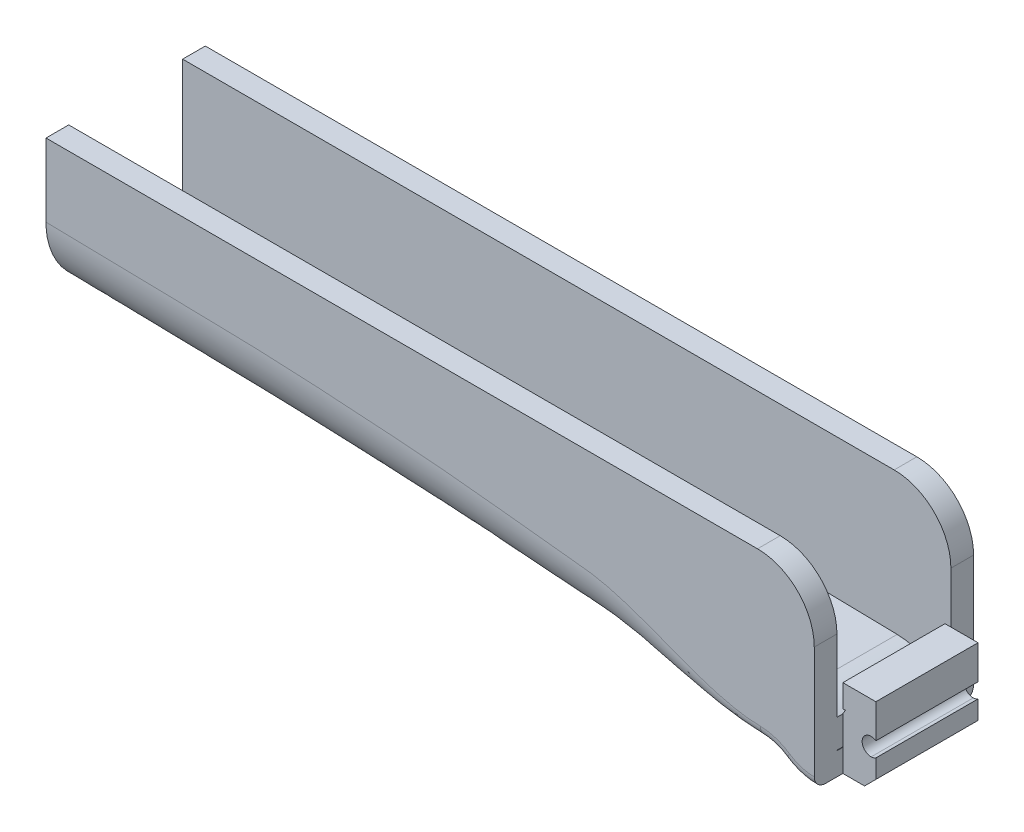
ISO-10303-21;
HEADER;
FILE_DESCRIPTION(('STEP AP214'),'2;1');
FILE_NAME('part.step','',(''),(''),'','','');
FILE_SCHEMA(('AUTOMOTIVE_DESIGN { 1 0 10303 214 1 1 1 1 }'));
ENDSEC;
DATA;
#1=APPLICATION_CONTEXT('core data for automotive mechanical design processes');
#2=APPLICATION_PROTOCOL_DEFINITION('international standard','automotive_design',2000,#1);
#3=PRODUCT_CONTEXT('',#1,'mechanical');
#4=PRODUCT('Part','Part','',(#3));
#5=PRODUCT_RELATED_PRODUCT_CATEGORY('part','',(#4));
#6=PRODUCT_DEFINITION_FORMATION('','',#4);
#7=PRODUCT_DEFINITION_CONTEXT('part definition',#1,'design');
#8=PRODUCT_DEFINITION('design','',#6,#7);
#9=PRODUCT_DEFINITION_SHAPE('','',#8);
#10=(LENGTH_UNIT() NAMED_UNIT(*) SI_UNIT(.MILLI.,.METRE.));
#11=(NAMED_UNIT(*) PLANE_ANGLE_UNIT() SI_UNIT($,.RADIAN.));
#12=(NAMED_UNIT(*) SI_UNIT($,.STERADIAN.) SOLID_ANGLE_UNIT());
#13=UNCERTAINTY_MEASURE_WITH_UNIT(LENGTH_MEASURE(1.E-05),#10,'distance_accuracy_value','');
#14=(GEOMETRIC_REPRESENTATION_CONTEXT(3) GLOBAL_UNCERTAINTY_ASSIGNED_CONTEXT((#13)) GLOBAL_UNIT_ASSIGNED_CONTEXT((#10,
#11,#12)) REPRESENTATION_CONTEXT('',''));
#15=CARTESIAN_POINT('',(0.,0.,0.));
#16=DIRECTION('',(0.,0.,1.));
#17=DIRECTION('',(1.,0.,0.));
#18=AXIS2_PLACEMENT_3D('',#15,#16,#17);
#19=CARTESIAN_POINT('',(-6.30237499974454,0.,17.8308));
#20=DIRECTION('',(-1.,0.,0.));
#21=DIRECTION('',(0.,0.,1.));
#22=AXIS2_PLACEMENT_3D('',#19,#20,#21);
#23=PLANE('',#22);
#24=DIRECTION('',(0.,1.,0.));
#25=VECTOR('',#24,1.);
#26=CARTESIAN_POINT('',(-6.30237499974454,0.,-17.8308));
#27=LINE('',#26,#25);
#28=CARTESIAN_POINT('',(-6.30237499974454,-5.82828405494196,-17.8308));
#29=VERTEX_POINT('',#28);
#30=CARTESIAN_POINT('',(-6.30237499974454,19.3338317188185,-17.8308));
#31=VERTEX_POINT('',#30);
#32=EDGE_CURVE('E412',#29,#31,#27,.T.);
#33=ORIENTED_EDGE('',*,*,#32,.T.);
#34=DIRECTION('',(0.,0.,-1.));
#35=VECTOR('',#34,1.);
#36=CARTESIAN_POINT('',(-6.30237499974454,19.3338317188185,17.8308));
#37=LINE('',#36,#35);
#38=CARTESIAN_POINT('',(-6.30237499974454,19.3338317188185,-12.7508));
#39=VERTEX_POINT('',#38);
#40=EDGE_CURVE('E319',#39,#31,#37,.T.);
#41=ORIENTED_EDGE('',*,*,#40,.F.);
#42=DIRECTION('',(0.,1.,0.));
#43=VECTOR('',#42,1.);
#44=CARTESIAN_POINT('',(-6.30237499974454,0.,-12.7508));
#45=LINE('',#44,#43);
#46=CARTESIAN_POINT('',(-6.30237499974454,3.19110455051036,-12.7508));
#47=VERTEX_POINT('',#46);
#48=EDGE_CURVE('E332',#47,#39,#45,.T.);
#49=ORIENTED_EDGE('',*,*,#48,.F.);
#50=DIRECTION('',(0.,0.,-1.));
#51=VECTOR('',#50,1.);
#52=CARTESIAN_POINT('',(-6.30237499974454,3.19110455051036,17.8308));
#53=LINE('',#52,#51);
#54=CARTESIAN_POINT('',(-6.30237499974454,3.19110455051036,-11.43));
#55=VERTEX_POINT('',#54);
#56=EDGE_CURVE('E657',#55,#47,#53,.T.);
#57=ORIENTED_EDGE('',*,*,#56,.F.);
#58=DIRECTION('',(0.,1.,0.));
#59=VECTOR('',#58,1.);
#60=CARTESIAN_POINT('',(-6.30237499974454,-12.7,-11.43));
#61=LINE('',#60,#59);
#62=CARTESIAN_POINT('',(-6.30237499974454,-3.19110455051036,-11.43));
#63=VERTEX_POINT('',#62);
#64=EDGE_CURVE('E648',#63,#55,#61,.T.);
#65=ORIENTED_EDGE('',*,*,#64,.F.);
#66=DIRECTION('',(0.,0.,-1.));
#67=VECTOR('',#66,1.);
#68=CARTESIAN_POINT('',(-6.30237499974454,-3.19110455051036,17.8308));
#69=LINE('',#68,#67);
#70=CARTESIAN_POINT('',(-6.30237499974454,-3.19110455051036,-12.7508));
#71=VERTEX_POINT('',#70);
#72=EDGE_CURVE('E54',#71,#63,#69,.F.);
#73=ORIENTED_EDGE('',*,*,#72,.F.);
#74=DIRECTION('',(0.,-1.,0.));
#75=VECTOR('',#74,1.);
#76=CARTESIAN_POINT('',(-6.30237499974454,0.,-12.7508));
#77=LINE('',#76,#75);
#78=CARTESIAN_POINT('',(-6.30237499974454,-3.28828405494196,-12.7508));
#79=VERTEX_POINT('',#78);
#80=EDGE_CURVE('E651',#71,#79,#77,.T.);
#81=ORIENTED_EDGE('',*,*,#80,.T.);
#82=DIRECTION('',(0.,0.,1.));
#83=VECTOR('',#82,1.);
#84=CARTESIAN_POINT('',(-6.30237499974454,-3.28828405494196,17.8308));
#85=LINE('',#84,#83);
#86=CARTESIAN_POINT('',(-6.30237499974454,-3.28828405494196,-11.43));
#87=VERTEX_POINT('',#86);
#88=EDGE_CURVE('E653',#79,#87,#85,.T.);
#89=ORIENTED_EDGE('',*,*,#88,.T.);
#90=CARTESIAN_POINT('',(-6.30237499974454,-8.36828405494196,-11.43));
#91=VERTEX_POINT('',#90);
#92=EDGE_CURVE('E649',#91,#87,#61,.T.);
#93=ORIENTED_EDGE('',*,*,#92,.F.);
#94=DIRECTION('',(0.,0.,1.));
#95=VECTOR('',#94,1.);
#96=CARTESIAN_POINT('',(-6.30237499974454,-8.36828405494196,17.8308));
#97=LINE('',#96,#95);
#98=CARTESIAN_POINT('',(-6.30237499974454,-8.36828405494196,-15.2908));
#99=VERTEX_POINT('',#98);
#100=EDGE_CURVE('E298',#99,#91,#97,.T.);
#101=ORIENTED_EDGE('',*,*,#100,.F.);
#102=CARTESIAN_POINT('',(-6.30237499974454,-5.82828405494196,-15.2908));
#103=DIRECTION('',(1.,0.,0.));
#104=DIRECTION('',(0.,0.,-1.));
#105=AXIS2_PLACEMENT_3D('',#102,#103,#104);
#106=CIRCLE('',#105,2.54);
#107=EDGE_CURVE('E581',#99,#29,#106,.T.);
#108=ORIENTED_EDGE('',*,*,#107,.T.);
#109=EDGE_LOOP('',(#33,#41,#49,#57,#65,#73,#81,#89,#93,#101,#108));
#110=FACE_BOUND('',#109,.T.);
#111=ADVANCED_FACE('F37',(#110),#23,.F.);
#112=CARTESIAN_POINT('',(-19.002375,19.3338317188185,17.8308));
#113=DIRECTION('',(0.,0.,1.));
#114=DIRECTION('',(1.,0.,0.));
#115=AXIS2_PLACEMENT_3D('',#112,#113,#114);
#116=ELLIPSE('',#115,12.7000000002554,12.6989512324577);
#117=DIRECTION('',(0.,0.,-1.));
#118=VECTOR('',#117,1.);
#119=SURFACE_OF_LINEAR_EXTRUSION('',#116,#118);
#120=CARTESIAN_POINT('',(-10.0221188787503,28.3133462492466,-12.7508));
#121=CARTESIAN_POINT('',(-10.2744350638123,28.5656452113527,-12.7508));
#122=CARTESIAN_POINT('',(-10.5373627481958,28.8072724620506,-12.7508));
#123=CARTESIAN_POINT('',(-11.0827129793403,29.2676121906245,-12.7508));
#124=CARTESIAN_POINT('',(-11.365140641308,29.4863186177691,-12.7508));
#125=CARTESIAN_POINT('',(-11.9477187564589,29.8993912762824,-12.7508));
#126=CARTESIAN_POINT('',(-12.2478879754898,30.0937310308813,-12.7508));
#127=CARTESIAN_POINT('',(-12.8635395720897,30.4564171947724,-12.7508));
#128=CARTESIAN_POINT('',(-13.1790218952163,30.6247636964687,-12.7508));
#129=CARTESIAN_POINT('',(-13.8228965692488,30.9341893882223,-12.7508));
#130=CARTESIAN_POINT('',(-14.1512825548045,31.0752818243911,-12.7508));
#131=CARTESIAN_POINT('',(-14.8187793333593,31.3293009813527,-12.7508));
#132=CARTESIAN_POINT('',(-15.1578902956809,31.4422272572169,-12.7508));
#133=CARTESIAN_POINT('',(-15.8443328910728,31.6390833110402,-12.7508));
#134=CARTESIAN_POINT('',(-16.1916624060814,31.7230204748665,-12.7508));
#135=CARTESIAN_POINT('',(-16.8921556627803,31.8613417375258,-12.7508));
#136=CARTESIAN_POINT('',(-17.2453193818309,31.9157259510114,-12.7508));
#137=CARTESIAN_POINT('',(-17.9550264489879,31.9945614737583,-12.7508));
#138=CARTESIAN_POINT('',(-18.3115703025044,32.0190082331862,-12.7508));
#139=CARTESIAN_POINT('',(-19.0254504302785,32.037780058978,-12.7508));
#140=CARTESIAN_POINT('',(-19.3827867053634,32.0321050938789,-12.7508));
#141=CARTESIAN_POINT('',(-20.0957250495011,31.9906729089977,-12.7508));
#142=CARTESIAN_POINT('',(-20.45132705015,31.9549145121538,-12.7508));
#143=CARTESIAN_POINT('',(-21.1582545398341,31.8535680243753,-12.7508));
#144=CARTESIAN_POINT('',(-21.5095800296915,31.7879799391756,-12.7508));
#145=CARTESIAN_POINT('',(-22.205457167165,31.6274400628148,-12.7508));
#146=CARTESIAN_POINT('',(-22.5500088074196,31.5324882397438,-12.7508));
#147=CARTESIAN_POINT('',(-23.2298881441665,31.3138956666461,-12.7508));
#148=CARTESIAN_POINT('',(-23.5652158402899,31.1902549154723,-12.7508));
#149=CARTESIAN_POINT('',(-24.2242623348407,30.9151634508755,-12.7508));
#150=CARTESIAN_POINT('',(-24.5479811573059,30.7637127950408,-12.7508));
#151=CARTESIAN_POINT('',(-25.1815087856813,30.43407772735,-12.7508));
#152=CARTESIAN_POINT('',(-25.4913175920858,30.2558933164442,-12.7508));
#153=CARTESIAN_POINT('',(-26.0948125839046,29.8740632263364,-12.7508));
#154=CARTESIAN_POINT('',(-26.3884992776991,29.6704183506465,-12.7508));
#155=CARTESIAN_POINT('',(-26.9576721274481,29.2391103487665,-12.7508));
#156=CARTESIAN_POINT('',(-27.2331582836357,29.0114472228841,-12.7508));
#157=CARTESIAN_POINT('',(-27.7639703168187,28.5337214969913,-12.7508));
#158=CARTESIAN_POINT('',(-28.0192962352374,28.2836589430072,-12.7508));
#159=CARTESIAN_POINT('',(-28.5079724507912,27.7629116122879,-12.7508));
#160=CARTESIAN_POINT('',(-28.7413227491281,27.4922268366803,-12.7508));
#161=CARTESIAN_POINT('',(-29.1843720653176,26.9321795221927,-12.7508));
#162=CARTESIAN_POINT('',(-29.3940727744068,26.6428183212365,-12.7508));
#163=CARTESIAN_POINT('',(-29.7883506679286,26.0474578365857,-12.7508));
#164=CARTESIAN_POINT('',(-29.9729278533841,25.7414585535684,-12.7508));
#165=CARTESIAN_POINT('',(-30.3156459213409,25.1149971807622,-12.7508));
#166=CARTESIAN_POINT('',(-30.473786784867,24.7945350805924,-12.7508));
#167=CARTESIAN_POINT('',(-30.762507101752,24.1414267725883,-12.7508));
#168=CARTESIAN_POINT('',(-30.8930865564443,23.8087805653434,-12.7508));
#169=CARTESIAN_POINT('',(-31.1257459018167,23.1336960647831,-12.7508));
#170=CARTESIAN_POINT('',(-31.2278280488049,22.7912585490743,-12.7508));
#171=CARTESIAN_POINT('',(-31.4027803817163,22.0990008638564,-12.7508));
#172=CARTESIAN_POINT('',(-31.4756505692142,21.7491806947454,-12.7508));
#173=CARTESIAN_POINT('',(-31.5916605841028,21.0446451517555,-12.7508));
#174=CARTESIAN_POINT('',(-31.6348004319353,20.6899297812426,-12.7508));
#175=CARTESIAN_POINT('',(-31.6910429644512,19.9781256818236,-12.7508));
#176=CARTESIAN_POINT('',(-31.7041456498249,19.621036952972,-12.7508));
#177=CARTESIAN_POINT('',(-31.7002207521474,18.9070433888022,-12.7508));
#178=CARTESIAN_POINT('',(-31.6831947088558,18.5501385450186,-12.7508));
#179=CARTESIAN_POINT('',(-31.6191364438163,17.8390319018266,-12.7508));
#180=CARTESIAN_POINT('',(-31.572104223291,17.4848301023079,-12.7508));
#181=CARTESIAN_POINT('',(-31.4483681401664,16.7816476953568,-12.7508));
#182=CARTESIAN_POINT('',(-31.3716642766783,16.4326670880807,-12.7508));
#183=CARTESIAN_POINT('',(-31.1891304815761,15.7424080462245,-12.7508));
#184=CARTESIAN_POINT('',(-31.0833005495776,15.4011296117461,-12.7508));
#185=CARTESIAN_POINT('',(-30.8432674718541,14.7287014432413,-12.7508));
#186=CARTESIAN_POINT('',(-30.7090643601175,14.3975516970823,-12.7508));
#187=CARTESIAN_POINT('',(-30.4132393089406,13.7477344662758,-12.7508));
#188=CARTESIAN_POINT('',(-30.2516173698,13.4290669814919,-12.7508));
#189=CARTESIAN_POINT('',(-29.9021040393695,12.8064793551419,-12.7508));
#190=CARTESIAN_POINT('',(-29.714212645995,12.5025592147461,-12.7508));
#191=CARTESIAN_POINT('',(-29.3134965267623,11.9116264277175,-12.7508));
#192=CARTESIAN_POINT('',(-29.1006717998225,11.6246137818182,-12.7508));
#193=CARTESIAN_POINT('',(-28.6515912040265,11.0695220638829,-12.7508));
#194=CARTESIAN_POINT('',(-28.4153341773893,10.8014439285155,-12.7508));
#195=CARTESIAN_POINT('',(-27.921077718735,10.2861421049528,-12.7508));
#196=CARTESIAN_POINT('',(-27.6630782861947,10.0389184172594,-12.7508));
#197=CARTESIAN_POINT('',(-27.1271713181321,9.56708231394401,-12.7508));
#198=CARTESIAN_POINT('',(-26.8492637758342,9.3424699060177,-12.7508));
#199=CARTESIAN_POINT('',(-26.2755164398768,8.91745253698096,-12.7508));
#200=CARTESIAN_POINT('',(-25.9796766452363,8.71704757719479,-12.7508));
#201=CARTESIAN_POINT('',(-25.3721440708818,8.34185434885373,-12.7508));
#202=CARTESIAN_POINT('',(-25.0604500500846,8.16706808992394,-12.7508));
#203=CARTESIAN_POINT('',(-24.4234463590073,7.84437302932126,-12.7508));
#204=CARTESIAN_POINT('',(-24.0981366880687,7.69646422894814,-12.7508));
#205=CARTESIAN_POINT('',(-23.4362142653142,7.42857502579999,-12.7508));
#206=CARTESIAN_POINT('',(-23.0996015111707,7.30859462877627,-12.7508));
#207=CARTESIAN_POINT('',(-22.4174658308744,7.09741473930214,-12.7508));
#208=CARTESIAN_POINT('',(-22.0719429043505,7.00621524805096,-12.7508));
#209=CARTESIAN_POINT('',(-21.3744175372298,6.85323955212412,-12.7508));
#210=CARTESIAN_POINT('',(-21.022414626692,6.7914654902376,-12.7508));
#211=CARTESIAN_POINT('',(-20.314456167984,6.69778945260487,-12.7508));
#212=CARTESIAN_POINT('',(-19.9585006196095,6.66588747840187,-12.7508));
#213=CARTESIAN_POINT('',(-19.2451671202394,6.63218228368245,-12.7508));
#214=CARTESIAN_POINT('',(-18.8877891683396,6.63037908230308,-12.7508));
#215=CARTESIAN_POINT('',(-18.1741516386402,6.65688429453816,-12.7508));
#216=CARTESIAN_POINT('',(-17.8178920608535,6.685192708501,-12.7508));
#217=CARTESIAN_POINT('',(-17.1090111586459,6.77172156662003,-12.7508));
#218=CARTESIAN_POINT('',(-16.7563899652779,6.82994308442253,-12.7508));
#219=CARTESIAN_POINT('',(-16.0573058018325,6.97588502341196,-12.7508));
#220=CARTESIAN_POINT('',(-15.7108428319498,7.06360544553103,-12.7508));
#221=CARTESIAN_POINT('',(-15.0265387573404,7.26792172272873,-12.7508));
#222=CARTESIAN_POINT('',(-14.6886976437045,7.38451754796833,-12.7508));
#223=CARTESIAN_POINT('',(-14.0240390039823,7.64575607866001,-12.7508));
#224=CARTESIAN_POINT('',(-13.6972214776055,7.79039878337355,-12.7508));
#225=CARTESIAN_POINT('',(-13.0569395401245,8.10670028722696,-12.7508));
#226=CARTESIAN_POINT('',(-12.7434748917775,8.27835860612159,-12.7508));
#227=CARTESIAN_POINT('',(-12.1321215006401,8.64747318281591,-12.7508));
#228=CARTESIAN_POINT('',(-11.8342327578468,8.8449294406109,-12.7508));
#229=CARTESIAN_POINT('',(-11.2561490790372,9.26423676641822,-12.7508));
#230=CARTESIAN_POINT('',(-10.9759541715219,9.48608787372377,-12.7508));
#231=CARTESIAN_POINT('',(-10.4352513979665,9.95260764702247,-12.7508));
#232=CARTESIAN_POINT('',(-10.1747435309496,10.1972763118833,-12.7508));
#233=CARTESIAN_POINT('',(-9.67528383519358,10.7076753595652,-12.7508));
#234=CARTESIAN_POINT('',(-9.43633061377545,10.9734043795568,-12.7508));
#235=CARTESIAN_POINT('',(-8.98166072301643,11.5240489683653,-12.7508));
#236=CARTESIAN_POINT('',(-8.76594405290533,11.8089645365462,-12.7508));
#237=CARTESIAN_POINT('',(-8.35928124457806,12.3959572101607,-12.7508));
#238=CARTESIAN_POINT('',(-8.16833514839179,12.6980343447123,-12.7508));
#239=CARTESIAN_POINT('',(-7.81257217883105,13.317202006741,-12.7508));
#240=CARTESIAN_POINT('',(-7.64775530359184,13.6342925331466,-12.7508));
#241=CARTESIAN_POINT('',(-7.34543261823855,14.2812123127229,-12.7508));
#242=CARTESIAN_POINT('',(-7.20792511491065,14.6110407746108,-12.7508));
#243=CARTESIAN_POINT('',(-6.96118651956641,15.2811099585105,-12.7508));
#244=CARTESIAN_POINT('',(-6.85195543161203,15.6213506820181,-12.7508));
#245=CARTESIAN_POINT('',(-6.66255046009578,16.309811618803,-12.7508));
#246=CARTESIAN_POINT('',(-6.58237543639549,16.658031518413,-12.7508));
#247=CARTESIAN_POINT('',(-6.45164698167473,17.3599875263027,-12.7508));
#248=CARTESIAN_POINT('',(-6.40109351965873,17.7137236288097,-12.7508));
#249=CARTESIAN_POINT('',(-6.3299737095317,18.4241370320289,-12.7508));
#250=CARTESIAN_POINT('',(-6.30940228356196,18.7808138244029,-12.7508));
#251=CARTESIAN_POINT('',(-6.29837660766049,19.4946339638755,-12.7508));
#252=CARTESIAN_POINT('',(-6.30792247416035,19.8517773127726,-12.7508));
#253=CARTESIAN_POINT('',(-6.35707006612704,20.5640815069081,-12.7508));
#254=CARTESIAN_POINT('',(-6.39667944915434,20.9192418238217,-12.7508));
#255=CARTESIAN_POINT('',(-6.50568033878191,21.6249565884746,-12.7508));
#256=CARTESIAN_POINT('',(-6.57507137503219,21.9755111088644,-12.7508));
#257=CARTESIAN_POINT('',(-6.74318139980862,22.6696896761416,-12.7508));
#258=CARTESIAN_POINT('',(-6.84191405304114,23.0133104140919,-12.7508));
#259=CARTESIAN_POINT('',(-7.06799151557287,23.6910067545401,-12.7508));
#260=CARTESIAN_POINT('',(-7.19533642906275,24.0250823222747,-12.7508));
#261=CARTESIAN_POINT('',(-7.4775841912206,24.6809621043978,-12.7508));
#262=CARTESIAN_POINT('',(-7.63245725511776,25.0027791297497,-12.7508));
#263=CARTESIAN_POINT('',(-7.96869107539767,25.6321302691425,-12.7508));
#264=CARTESIAN_POINT('',(-8.15004485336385,25.9396681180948,-12.7508));
#265=CARTESIAN_POINT('',(-8.58628709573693,26.6128930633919,-12.7508));
#266=CARTESIAN_POINT('',(-8.84824755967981,26.9740256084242,-12.7508));
#267=CARTESIAN_POINT('',(-9.40866547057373,27.6667649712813,-12.7508));
#268=CARTESIAN_POINT('',(-9.70712291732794,27.9983717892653,-12.7508));
#269=CARTESIAN_POINT('',(-10.0221188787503,28.3133462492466,-12.7508));
#270=B_SPLINE_CURVE_WITH_KNOTS('',3,(#120,#121,#122,#123,#124,#125,#126,#127,#128,#129,#130,
#131,#132,#133,#134,#135,#136,#137,#138,#139,#140,#141,#142,#143,#144,#145,#146,#147,#148,#149,
#150,#151,#152,#153,#154,#155,#156,#157,#158,#159,#160,#161,#162,#163,#164,#165,#166,#167,#168,
#169,#170,#171,#172,#173,#174,#175,#176,#177,#178,#179,#180,#181,#182,#183,#184,#185,#186,#187,
#188,#189,#190,#191,#192,#193,#194,#195,#196,#197,#198,#199,#200,#201,#202,#203,#204,#205,#206,
#207,#208,#209,#210,#211,#212,#213,#214,#215,#216,#217,#218,#219,#220,#221,#222,#223,#224,#225,
#226,#227,#228,#229,#230,#231,#232,#233,#234,#235,#236,#237,#238,#239,#240,#241,#242,#243,#244,
#245,#246,#247,#248,#249,#250,#251,#252,#253,#254,#255,#256,#257,#258,#259,#260,#261,#262,#263,
#264,#265,#266,#267,#268,#269),.UNSPECIFIED.,.T.,.F.,(4,2,2,2,2,2,2,2,2,2,2,2,2,2,2,2,2,2,2,2,2,
2,2,2,2,2,2,2,2,2,2,2,2,2,2,2,2,2,2,2,2,2,2,2,2,2,2,2,2,2,2,2,2,2,2,2,2,2,2,2,2,2,2,2,2,2,2,2,2,
2,2,2,2,2,4),(0.,1.07006121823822,2.14040420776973,3.21190033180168,4.28339264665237,
5.35436287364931,6.42535001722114,7.49606409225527,8.56677401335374,9.63764663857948,
10.7085203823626,11.7794360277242,12.8503514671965,13.9212680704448,14.9921847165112,
16.0630991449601,17.1340135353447,18.2048941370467,19.2757747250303,20.3466531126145,
21.417531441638,22.4883331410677,23.5591347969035,24.6299372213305,25.7007395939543,
26.7714571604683,27.8421746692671,28.9128914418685,29.9836081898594,31.0542702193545,
32.1249322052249,33.1955942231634,34.2662562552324,35.3369170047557,36.4075777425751,
37.4782385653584,38.5488994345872,39.6196132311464,40.6903270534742,41.7610412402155,
42.8317554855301,43.9025536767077,44.9733519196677,46.0441503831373,47.1149488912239,
48.1858253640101,49.2567018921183,50.3275791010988,51.3984563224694,52.4693719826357,
53.5402876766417,54.6112022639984,55.6821168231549,56.7530123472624,57.823907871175,
58.8948051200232,59.9657023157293,61.0365302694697,62.1073581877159,63.1781879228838,
64.2490175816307,65.3197808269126,66.3905442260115,67.4612656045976,68.5319858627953,
69.6025247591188,70.673067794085,71.743883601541,72.8146824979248,73.8859808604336,
74.9572831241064,76.0274332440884,77.0973018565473,78.4331851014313,79.7690683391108),.UNSPECIFIED.);
#271=CARTESIAN_POINT('',(-19.002375,32.0327829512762,-12.7508));
#272=VERTEX_POINT('',#271);
#273=EDGE_CURVE('E692',#39,#272,#270,.T.);
#274=ORIENTED_EDGE('',*,*,#273,.F.);
#275=ORIENTED_EDGE('',*,*,#40,.T.);
#276=CARTESIAN_POINT('',(-19.002375,19.3338317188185,-17.8308));
#277=DIRECTION('',(0.,0.,1.));
#278=DIRECTION('',(1.,0.,0.));
#279=AXIS2_PLACEMENT_3D('',#276,#277,#278);
#280=ELLIPSE('',#279,12.7000000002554,12.6989512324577);
#281=CARTESIAN_POINT('',(-19.002375,32.0327829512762,-17.8308));
#282=VERTEX_POINT('',#281);
#283=EDGE_CURVE('E829',#31,#282,#280,.T.);
#284=ORIENTED_EDGE('',*,*,#283,.T.);
#285=DIRECTION('',(0.,0.,-1.));
#286=VECTOR('',#285,1.);
#287=CARTESIAN_POINT('',(-19.002375,32.0327829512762,17.8308));
#288=LINE('',#287,#286);
#289=EDGE_CURVE('E315',#272,#282,#288,.T.);
#290=ORIENTED_EDGE('',*,*,#289,.F.);
#291=EDGE_LOOP('',(#274,#275,#284,#290));
#292=FACE_BOUND('',#291,.T.);
#293=ADVANCED_FACE('F398',(#292),#119,.F.);
#294=CARTESIAN_POINT('',(0.,32.0327829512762,17.8308));
#295=DIRECTION('',(0.,-1.,0.));
#296=DIRECTION('',(0.,0.,-1.));
#297=AXIS2_PLACEMENT_3D('',#294,#295,#296);
#298=PLANE('',#297);
#299=DIRECTION('',(-1.,0.,0.));
#300=VECTOR('',#299,1.);
#301=CARTESIAN_POINT('',(0.,32.0327829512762,-12.7508));
#302=LINE('',#301,#300);
#303=CARTESIAN_POINT('',(-178.260374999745,32.0327829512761,-12.7508));
#304=VERTEX_POINT('',#303);
#305=EDGE_CURVE('E776',#272,#304,#302,.T.);
#306=ORIENTED_EDGE('',*,*,#305,.F.);
#307=ORIENTED_EDGE('',*,*,#289,.T.);
#308=DIRECTION('',(-1.,0.,0.));
#309=VECTOR('',#308,1.);
#310=CARTESIAN_POINT('',(0.,32.0327829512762,-17.8308));
#311=LINE('',#310,#309);
#312=CARTESIAN_POINT('',(-178.260374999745,32.0327829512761,-17.8308));
#313=VERTEX_POINT('',#312);
#314=EDGE_CURVE('E825',#282,#313,#311,.T.);
#315=ORIENTED_EDGE('',*,*,#314,.T.);
#316=DIRECTION('',(0.,0.,-1.));
#317=VECTOR('',#316,1.);
#318=CARTESIAN_POINT('',(-178.260374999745,32.0327829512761,17.8308));
#319=LINE('',#318,#317);
#320=EDGE_CURVE('E311',#304,#313,#319,.T.);
#321=ORIENTED_EDGE('',*,*,#320,.F.);
#322=EDGE_LOOP('',(#306,#307,#315,#321));
#323=FACE_BOUND('',#322,.T.);
#324=ADVANCED_FACE('F384',(#323),#298,.F.);
#325=CARTESIAN_POINT('',(-178.260374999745,0.,17.8308));
#326=DIRECTION('',(-1.,0.,0.));
#327=DIRECTION('',(0.,0.,1.));
#328=AXIS2_PLACEMENT_3D('',#325,#326,#327);
#329=PLANE('',#328);
#330=DIRECTION('',(0.,1.,0.));
#331=VECTOR('',#330,1.);
#332=CARTESIAN_POINT('',(-178.260374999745,0.,-17.8308));
#333=LINE('',#332,#331);
#334=CARTESIAN_POINT('',(-178.260374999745,15.71583251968,-17.8308));
#335=VERTEX_POINT('',#334);
#336=EDGE_CURVE('E828',#335,#313,#333,.T.);
#337=ORIENTED_EDGE('',*,*,#336,.F.);
#338=CARTESIAN_POINT('',(-178.260374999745,15.71583251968,-17.8308));
#339=CARTESIAN_POINT('',(-178.260374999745,15.3942292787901,-17.8308102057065));
#340=CARTESIAN_POINT('',(-178.260374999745,15.0726271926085,-17.821755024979));
#341=CARTESIAN_POINT('',(-178.260374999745,14.4304549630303,-17.7855882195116));
#342=CARTESIAN_POINT('',(-178.260374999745,14.1098847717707,-17.758477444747));
#343=CARTESIAN_POINT('',(-178.260374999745,13.4707807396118,-17.6862743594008));
#344=CARTESIAN_POINT('',(-178.260374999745,13.1522468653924,-17.6411823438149));
#345=CARTESIAN_POINT('',(-178.260374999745,12.5184551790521,-17.5332033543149));
#346=CARTESIAN_POINT('',(-178.260374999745,12.2031951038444,-17.4703296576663));
#347=CARTESIAN_POINT('',(-178.260374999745,11.5767040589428,-17.3269694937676));
#348=CARTESIAN_POINT('',(-178.260374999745,11.2654730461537,-17.2464832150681));
#349=CARTESIAN_POINT('',(-178.260374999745,10.6480416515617,-17.0681611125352));
#350=CARTESIAN_POINT('',(-178.260374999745,10.3418412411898,-16.9703253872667));
#351=CARTESIAN_POINT('',(-178.260374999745,9.5836273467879,-16.7043527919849));
#352=CARTESIAN_POINT('',(-178.260374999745,9.13531783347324,-16.5255346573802));
#353=CARTESIAN_POINT('',(-178.260374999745,8.25528909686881,-16.1307182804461));
#354=CARTESIAN_POINT('',(-178.260374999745,7.82357206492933,-15.9147151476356));
#355=CARTESIAN_POINT('',(-178.260374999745,7.19091157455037,-15.5640793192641));
#356=CARTESIAN_POINT('',(-178.260374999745,6.98249831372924,-15.4427539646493));
#357=CARTESIAN_POINT('',(-178.260374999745,6.57102979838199,-15.1914621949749));
#358=CARTESIAN_POINT('',(-178.260374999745,6.3679730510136,-15.0614982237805));
#359=CARTESIAN_POINT('',(-178.260374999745,5.76725886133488,-14.6589050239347));
#360=CARTESIAN_POINT('',(-178.260374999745,5.37802069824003,-14.3735541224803));
#361=CARTESIAN_POINT('',(-178.260374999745,4.62506828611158,-13.7711465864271));
#362=CARTESIAN_POINT('',(-178.260374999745,4.2613508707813,-13.4540938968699));
#363=CARTESIAN_POINT('',(-178.260374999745,3.56190370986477,-12.7904623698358));
#364=CARTESIAN_POINT('',(-178.260374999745,3.2261741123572,-12.44388337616));
#365=CARTESIAN_POINT('',(-178.260374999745,2.58504725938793,-11.7236024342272));
#366=CARTESIAN_POINT('',(-178.260374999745,2.2796561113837,-11.3498950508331));
#367=CARTESIAN_POINT('',(-178.260374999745,1.701456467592,-10.5780789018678));
#368=CARTESIAN_POINT('',(-178.260374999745,1.42864746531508,-10.1799705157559));
#369=CARTESIAN_POINT('',(-178.260374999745,0.917553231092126,-9.36218463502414));
#370=CARTESIAN_POINT('',(-178.260374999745,0.679267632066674,-8.94250736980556));
#371=CARTESIAN_POINT('',(-178.260374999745,0.238899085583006,-8.08453421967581));
#372=CARTESIAN_POINT('',(-178.260374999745,0.0368183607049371,-7.6462371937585));
#373=CARTESIAN_POINT('',(-178.260374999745,-0.329588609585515,-6.75440597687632));
#374=CARTESIAN_POINT('',(-178.260374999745,-0.493933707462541,-6.30087952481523));
#375=CARTESIAN_POINT('',(-178.260374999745,-0.783803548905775,-5.38165930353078));
#376=CARTESIAN_POINT('',(-178.260374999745,-0.909337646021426,-4.9159684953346));
#377=CARTESIAN_POINT('',(-178.260374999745,-1.08437917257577,-4.13743428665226));
#378=CARTESIAN_POINT('',(-178.260374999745,-1.14518687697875,-3.82708195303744));
#379=CARTESIAN_POINT('',(-178.260374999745,-1.24954848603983,-3.2034946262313));
#380=CARTESIAN_POINT('',(-178.260374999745,-1.29310371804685,-2.89025985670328));
#381=CARTESIAN_POINT('',(-178.260374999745,-1.36277097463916,-2.26233432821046));
#382=CARTESIAN_POINT('',(-178.260374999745,-1.38890890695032,-1.94764643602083));
#383=CARTESIAN_POINT('',(-178.260374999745,-1.42378204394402,-1.31724028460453));
#384=CARTESIAN_POINT('',(-178.260374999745,-1.43251351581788,-1.00152181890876));
#385=CARTESIAN_POINT('',(-178.260374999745,-1.43250447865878,-0.685800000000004));
#386=B_SPLINE_CURVE_WITH_KNOTS('',3,(#338,#339,#340,#341,#342,#343,#344,#345,#346,#347,#348,
#349,#350,#351,#352,#353,#354,#355,#356,#357,#358,#359,#360,#361,#362,#363,#364,#365,#366,#367,
#368,#369,#370,#371,#372,#373,#374,#375,#376,#377,#378,#379,#380,#381,#382,#383,#384,#385),
.UNSPECIFIED.,.F.,.F.,(4,2,2,2,2,2,2,2,2,2,2,2,2,2,2,2,2,2,2,2,2,2,2,4),(0.,0.96468053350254,
1.9293156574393,2.89393495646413,3.85783588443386,4.82172649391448,5.78561162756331,
7.23180208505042,8.67818288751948,9.40146164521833,10.1245366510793,11.5705609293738,
13.0164054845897,14.4622576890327,15.9084003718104,17.3545205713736,18.8006253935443,
20.2468189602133,21.692288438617,23.1374092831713,24.0857314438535,25.0339806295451,
25.9808161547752,26.9278547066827),.UNSPECIFIED.);
#387=CARTESIAN_POINT('',(-178.260374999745,-1.43250447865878,-0.685800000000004));
#388=VERTEX_POINT('',#387);
#389=EDGE_CURVE('E373',#335,#388,#386,.T.);
#390=ORIENTED_EDGE('',*,*,#389,.T.);
#391=DIRECTION('',(0.,0.,-1.));
#392=VECTOR('',#391,1.);
#393=CARTESIAN_POINT('',(-178.260374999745,-1.43250447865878,17.8308));
#394=LINE('',#393,#392);
#395=CARTESIAN_POINT('',(-178.260374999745,-1.43250447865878,0.685800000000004));
#396=VERTEX_POINT('',#395);
#397=EDGE_CURVE('E308',#396,#388,#394,.T.);
#398=ORIENTED_EDGE('',*,*,#397,.F.);
#399=CARTESIAN_POINT('',(-178.260374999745,-1.43250447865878,0.685800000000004));
#400=CARTESIAN_POINT('',(-178.260374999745,-1.43251470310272,1.00722532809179));
#401=CARTESIAN_POINT('',(-178.260374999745,-1.42346423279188,1.32864949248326));
#402=CARTESIAN_POINT('',(-178.260374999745,-1.38731638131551,1.97046614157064));
#403=CARTESIAN_POINT('',(-178.260374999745,-1.36021986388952,2.29085867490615));
#404=CARTESIAN_POINT('',(-178.260374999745,-1.28805498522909,2.92960834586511));
#405=CARTESIAN_POINT('',(-178.260374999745,-1.2429869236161,3.24796551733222));
#406=CARTESIAN_POINT('',(-178.260374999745,-1.13506635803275,3.88140211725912));
#407=CARTESIAN_POINT('',(-178.260374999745,-1.07222731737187,4.19648384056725));
#408=CARTESIAN_POINT('',(-178.260374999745,-0.928947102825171,4.82262062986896));
#409=CARTESIAN_POINT('',(-178.260374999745,-0.848506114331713,5.13367573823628));
#410=CARTESIAN_POINT('',(-178.260374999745,-0.67028561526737,5.75075854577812));
#411=CARTESIAN_POINT('',(-178.260374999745,-0.57250620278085,6.05678627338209));
#412=CARTESIAN_POINT('',(-178.260374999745,-0.30668641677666,6.81458013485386));
#413=CARTESIAN_POINT('',(-178.260374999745,-0.127971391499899,7.26264465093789));
#414=CARTESIAN_POINT('',(-178.260374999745,0.266612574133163,8.14219583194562));
#415=CARTESIAN_POINT('',(-178.260374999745,0.482486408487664,8.57368030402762));
#416=CARTESIAN_POINT('',(-178.260374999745,0.832908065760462,9.20600524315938));
#417=CARTESIAN_POINT('',(-178.260374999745,0.954158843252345,9.41430914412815));
#418=CARTESIAN_POINT('',(-178.260374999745,1.2052945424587,9.82556375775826));
#419=CARTESIAN_POINT('',(-178.260374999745,1.33517702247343,10.0285159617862));
#420=CARTESIAN_POINT('',(-178.260374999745,1.73751518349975,10.6289246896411));
#421=CARTESIAN_POINT('',(-178.260374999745,2.02268188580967,11.0179699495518));
#422=CARTESIAN_POINT('',(-178.260374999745,2.62476160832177,11.7706502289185));
#423=CARTESIAN_POINT('',(-178.260374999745,2.94167795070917,12.1342825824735));
#424=CARTESIAN_POINT('',(-178.260374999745,3.60502188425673,12.8335797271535));
#425=CARTESIAN_POINT('',(-178.260374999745,3.9514496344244,13.1692443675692));
#426=CARTESIAN_POINT('',(-178.260374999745,4.67141318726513,13.8102664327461));
#427=CARTESIAN_POINT('',(-178.260374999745,5.04495442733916,14.1156177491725));
#428=CARTESIAN_POINT('',(-178.260374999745,5.81642440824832,14.6937680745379));
#429=CARTESIAN_POINT('',(-178.260374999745,6.21435277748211,14.966567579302));
#430=CARTESIAN_POINT('',(-178.260374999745,7.03191707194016,15.4777722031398));
#431=CARTESIAN_POINT('',(-178.260374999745,7.45156068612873,15.716165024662));
#432=CARTESIAN_POINT('',(-178.260374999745,8.30947057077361,16.1567611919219));
#433=CARTESIAN_POINT('',(-178.260374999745,8.74773798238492,16.3589623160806));
#434=CARTESIAN_POINT('',(-178.260374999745,9.63951739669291,16.725627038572));
#435=CARTESIAN_POINT('',(-178.260374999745,10.0930217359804,16.8901092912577));
#436=CARTESIAN_POINT('',(-178.260374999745,11.0122050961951,17.1802715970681));
#437=CARTESIAN_POINT('',(-178.260374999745,11.4778811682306,17.3059609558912));
#438=CARTESIAN_POINT('',(-178.260374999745,12.2570290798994,17.4814176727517));
#439=CARTESIAN_POINT('',(-178.260374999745,12.5680145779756,17.5424448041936));
#440=CARTESIAN_POINT('',(-178.260374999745,13.1928831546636,17.6471831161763));
#441=CARTESIAN_POINT('',(-178.260374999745,13.5067660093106,17.6908956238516));
#442=CARTESIAN_POINT('',(-178.260374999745,14.1359969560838,17.760814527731));
#443=CARTESIAN_POINT('',(-178.260374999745,14.4513421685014,17.7870469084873));
#444=CARTESIAN_POINT('',(-178.260374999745,15.0830678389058,17.8220460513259));
#445=CARTESIAN_POINT('',(-178.260374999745,15.3994485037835,17.8308090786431));
#446=CARTESIAN_POINT('',(-178.260374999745,15.71583251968,17.8308));
#447=B_SPLINE_CURVE_WITH_KNOTS('',3,(#399,#400,#401,#402,#403,#404,#405,#406,#407,#408,#409,
#410,#411,#412,#413,#414,#415,#416,#417,#418,#419,#420,#421,#422,#423,#424,#425,#426,#427,#428,
#429,#430,#431,#432,#433,#434,#435,#436,#437,#438,#439,#440,#441,#442,#443,#444,#445,#446),
.UNSPECIFIED.,.F.,.F.,(4,2,2,2,2,2,2,2,2,2,2,2,2,2,2,2,2,2,2,2,2,2,2,4),(0.,0.96414684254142,
1.92824754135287,2.8923321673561,3.85568834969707,4.81903438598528,5.78237497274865,
7.2277695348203,8.67335460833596,9.39623748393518,10.1189167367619,11.5641500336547,
13.0095347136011,14.4549271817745,15.9006103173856,17.3462714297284,18.7924479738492,
20.2387132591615,21.6842617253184,23.1294631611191,24.0797734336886,25.0300108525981,
25.9788325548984,26.9278570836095),.UNSPECIFIED.);
#448=CARTESIAN_POINT('',(-178.260374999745,15.71583251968,17.8308));
#449=VERTEX_POINT('',#448);
#450=EDGE_CURVE('E364',#396,#449,#447,.T.);
#451=ORIENTED_EDGE('',*,*,#450,.T.);
#452=DIRECTION('',(0.,1.,0.));
#453=VECTOR('',#452,1.);
#454=CARTESIAN_POINT('',(-178.260374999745,0.,17.8308));
#455=LINE('',#454,#453);
#456=CARTESIAN_POINT('',(-178.260374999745,32.0327829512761,17.8308));
#457=VERTEX_POINT('',#456);
#458=EDGE_CURVE('E408',#449,#457,#455,.T.);
#459=ORIENTED_EDGE('',*,*,#458,.T.);
#460=CARTESIAN_POINT('',(-178.260374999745,32.0327829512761,12.7508));
#461=VERTEX_POINT('',#460);
#462=EDGE_CURVE('E312',#457,#461,#319,.T.);
#463=ORIENTED_EDGE('',*,*,#462,.T.);
#464=DIRECTION('',(0.,1.,0.));
#465=VECTOR('',#464,1.);
#466=CARTESIAN_POINT('',(-178.260374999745,0.,12.7508));
#467=LINE('',#466,#465);
#468=CARTESIAN_POINT('',(-178.260374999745,3.64848426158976,12.7508));
#469=VERTEX_POINT('',#468);
#470=EDGE_CURVE('E763',#469,#461,#467,.T.);
#471=ORIENTED_EDGE('',*,*,#470,.F.);
#472=DIRECTION('',(0.,0.,-1.));
#473=VECTOR('',#472,1.);
#474=CARTESIAN_POINT('',(-178.260374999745,3.64848426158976,17.8308));
#475=LINE('',#474,#473);
#476=CARTESIAN_POINT('',(-178.260374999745,3.64848426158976,-12.7508));
#477=VERTEX_POINT('',#476);
#478=EDGE_CURVE('E766',#469,#477,#475,.T.);
#479=ORIENTED_EDGE('',*,*,#478,.T.);
#480=DIRECTION('',(0.,1.,0.));
#481=VECTOR('',#480,1.);
#482=CARTESIAN_POINT('',(-178.260374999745,0.,-12.7508));
#483=LINE('',#482,#481);
#484=EDGE_CURVE('E774',#477,#304,#483,.T.);
#485=ORIENTED_EDGE('',*,*,#484,.T.);
#486=ORIENTED_EDGE('',*,*,#320,.T.);
#487=EDGE_LOOP('',(#337,#390,#398,#451,#459,#463,#471,#479,#485,#486));
#488=FACE_BOUND('',#487,.T.);
#489=ADVANCED_FACE('F378',(#488),#329,.T.);
#490=CARTESIAN_POINT('',(0.,0.,17.8308));
#491=DIRECTION('',(0.,0.,-1.));
#492=DIRECTION('',(-1.,0.,0.));
#493=AXIS2_PLACEMENT_3D('',#490,#491,#492);
#494=CYLINDRICAL_SURFACE('',#493,1.98421113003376);
#495=CARTESIAN_POINT('',(0.,0.,11.43));
#496=DIRECTION('',(0.,0.,-1.));
#497=DIRECTION('',(-1.,0.,0.));
#498=AXIS2_PLACEMENT_3D('',#495,#496,#497);
#499=CIRCLE('',#498,1.98421113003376);
#500=CARTESIAN_POINT('',(0.0295900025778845,-1.98399052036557,11.43));
#501=VERTEX_POINT('',#500);
#502=CARTESIAN_POINT('',(1.08902500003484,1.65864955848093,11.43));
#503=VERTEX_POINT('',#502);
#504=EDGE_CURVE('E631',#501,#503,#499,.T.);
#505=ORIENTED_EDGE('',*,*,#504,.F.);
#506=DIRECTION('',(0.,0.,-1.));
#507=VECTOR('',#506,1.);
#508=CARTESIAN_POINT('',(0.0295900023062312,-1.98399050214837,17.8308));
#509=LINE('',#508,#507);
#510=CARTESIAN_POINT('',(0.0295900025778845,-1.98399052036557,-11.43));
#511=VERTEX_POINT('',#510);
#512=EDGE_CURVE('E300',#501,#511,#509,.T.);
#513=ORIENTED_EDGE('',*,*,#512,.T.);
#514=CARTESIAN_POINT('',(0.,0.,-11.43));
#515=DIRECTION('',(0.,0.,1.));
#516=DIRECTION('',(1.,0.,0.));
#517=AXIS2_PLACEMENT_3D('',#514,#515,#516);
#518=CIRCLE('',#517,1.98421113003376);
#519=CARTESIAN_POINT('',(1.08902500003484,1.65864955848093,-11.43));
#520=VERTEX_POINT('',#519);
#521=EDGE_CURVE('E662',#520,#511,#518,.T.);
#522=ORIENTED_EDGE('',*,*,#521,.F.);
#523=DIRECTION('',(0.,0.,-1.));
#524=VECTOR('',#523,1.);
#525=CARTESIAN_POINT('',(1.08902500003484,1.65864955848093,17.8308));
#526=LINE('',#525,#524);
#527=EDGE_CURVE('E327',#503,#520,#526,.T.);
#528=ORIENTED_EDGE('',*,*,#527,.F.);
#529=EDGE_LOOP('',(#505,#513,#522,#528));
#530=FACE_BOUND('',#529,.T.);
#531=ADVANCED_FACE('F383',(#530),#494,.F.);
#532=CARTESIAN_POINT('',(1.08902500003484,0.,17.8308));
#533=DIRECTION('',(1.,0.,0.));
#534=DIRECTION('',(0.,0.,-1.));
#535=AXIS2_PLACEMENT_3D('',#532,#533,#534);
#536=PLANE('',#535);
#537=DIRECTION('',(0.,1.,0.));
#538=VECTOR('',#537,1.);
#539=CARTESIAN_POINT('',(1.08902500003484,0.,11.43));
#540=LINE('',#539,#538);
#541=CARTESIAN_POINT('',(1.08902500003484,9.23736237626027,11.43));
#542=VERTEX_POINT('',#541);
#543=EDGE_CURVE('E633',#503,#542,#540,.T.);
#544=ORIENTED_EDGE('',*,*,#543,.F.);
#545=ORIENTED_EDGE('',*,*,#527,.T.);
#546=DIRECTION('',(0.,-1.,0.));
#547=VECTOR('',#546,1.);
#548=CARTESIAN_POINT('',(1.08902500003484,0.,-11.43));
#549=LINE('',#548,#547);
#550=CARTESIAN_POINT('',(1.08902500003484,9.23736237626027,-11.43));
#551=VERTEX_POINT('',#550);
#552=EDGE_CURVE('E665',#551,#520,#549,.T.);
#553=ORIENTED_EDGE('',*,*,#552,.F.);
#554=DIRECTION('',(0.,0.,-1.));
#555=VECTOR('',#554,1.);
#556=CARTESIAN_POINT('',(1.08902500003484,9.23736237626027,17.8308));
#557=LINE('',#556,#555);
#558=EDGE_CURVE('E325',#542,#551,#557,.T.);
#559=ORIENTED_EDGE('',*,*,#558,.F.);
#560=EDGE_LOOP('',(#544,#545,#553,#559));
#561=FACE_BOUND('',#560,.T.);
#562=ADVANCED_FACE('F447',(#561),#536,.T.);
#563=CARTESIAN_POINT('',(0.,9.23736237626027,17.8308));
#564=DIRECTION('',(0.,1.,0.));
#565=DIRECTION('',(0.,0.,1.));
#566=AXIS2_PLACEMENT_3D('',#563,#564,#565);
#567=PLANE('',#566);
#568=DIRECTION('',(-1.,0.,0.));
#569=VECTOR('',#568,1.);
#570=CARTESIAN_POINT('',(0.,9.23736237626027,11.43));
#571=LINE('',#570,#569);
#572=CARTESIAN_POINT('',(-6.30237499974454,9.23736237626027,11.43));
#573=VERTEX_POINT('',#572);
#574=EDGE_CURVE('E635',#542,#573,#571,.T.);
#575=ORIENTED_EDGE('',*,*,#574,.F.);
#576=ORIENTED_EDGE('',*,*,#558,.T.);
#577=DIRECTION('',(1.,0.,0.));
#578=VECTOR('',#577,1.);
#579=CARTESIAN_POINT('',(0.,9.23736237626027,-11.43));
#580=LINE('',#579,#578);
#581=CARTESIAN_POINT('',(-6.30237499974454,9.23736237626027,-11.43));
#582=VERTEX_POINT('',#581);
#583=EDGE_CURVE('E668',#582,#551,#580,.T.);
#584=ORIENTED_EDGE('',*,*,#583,.F.);
#585=DIRECTION('',(0.,0.,-1.));
#586=VECTOR('',#585,1.);
#587=CARTESIAN_POINT('',(-6.30237499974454,9.23736237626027,17.8308));
#588=LINE('',#587,#586);
#589=EDGE_CURVE('E323',#573,#582,#588,.T.);
#590=ORIENTED_EDGE('',*,*,#589,.F.);
#591=EDGE_LOOP('',(#575,#576,#584,#590));
#592=FACE_BOUND('',#591,.T.);
#593=ADVANCED_FACE('F443',(#592),#567,.T.);
#594=DIRECTION('',(0.,1.,0.));
#595=VECTOR('',#594,1.);
#596=CARTESIAN_POINT('',(-6.30237499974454,0.,12.7508));
#597=LINE('',#596,#595);
#598=CARTESIAN_POINT('',(-6.30237499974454,3.19110455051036,12.7508));
#599=VERTEX_POINT('',#598);
#600=CARTESIAN_POINT('',(-6.30237499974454,19.3338317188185,12.7508));
#601=VERTEX_POINT('',#600);
#602=EDGE_CURVE('E329',#599,#601,#597,.T.);
#603=ORIENTED_EDGE('',*,*,#602,.T.);
#604=CARTESIAN_POINT('',(-6.30237499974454,19.3338317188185,17.8308));
#605=VERTEX_POINT('',#604);
#606=EDGE_CURVE('E320',#605,#601,#37,.T.);
#607=ORIENTED_EDGE('',*,*,#606,.F.);
#608=DIRECTION('',(0.,1.,0.));
#609=VECTOR('',#608,1.);
#610=CARTESIAN_POINT('',(-6.30237499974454,0.,17.8308));
#611=LINE('',#610,#609);
#612=CARTESIAN_POINT('',(-6.30237499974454,-5.82828405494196,17.8308));
#613=VERTEX_POINT('',#612);
#614=EDGE_CURVE('E62',#613,#605,#611,.T.);
#615=ORIENTED_EDGE('',*,*,#614,.F.);
#616=CARTESIAN_POINT('',(-6.30237499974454,-5.82828405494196,15.2908));
#617=DIRECTION('',(1.,0.,0.));
#618=DIRECTION('',(0.,0.,-1.));
#619=AXIS2_PLACEMENT_3D('',#616,#617,#618);
#620=CIRCLE('',#619,2.54);
#621=CARTESIAN_POINT('',(-6.30237499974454,-8.36828405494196,15.2908));
#622=VERTEX_POINT('',#621);
#623=EDGE_CURVE('E265',#613,#622,#620,.T.);
#624=ORIENTED_EDGE('',*,*,#623,.T.);
#625=DIRECTION('',(0.,0.,-1.));
#626=VECTOR('',#625,1.);
#627=CARTESIAN_POINT('',(-6.30237499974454,-8.36828405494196,17.8308));
#628=LINE('',#627,#626);
#629=CARTESIAN_POINT('',(-6.30237499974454,-8.36828405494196,11.43));
#630=VERTEX_POINT('',#629);
#631=EDGE_CURVE('E259',#622,#630,#628,.T.);
#632=ORIENTED_EDGE('',*,*,#631,.T.);
#633=DIRECTION('',(0.,1.,0.));
#634=VECTOR('',#633,1.);
#635=CARTESIAN_POINT('',(-6.30237499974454,-12.7,11.43));
#636=LINE('',#635,#634);
#637=CARTESIAN_POINT('',(-6.30237499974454,-3.28828405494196,11.43));
#638=VERTEX_POINT('',#637);
#639=EDGE_CURVE('E262',#630,#638,#636,.T.);
#640=ORIENTED_EDGE('',*,*,#639,.T.);
#641=DIRECTION('',(0.,0.,1.));
#642=VECTOR('',#641,1.);
#643=CARTESIAN_POINT('',(-6.30237499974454,-3.28828405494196,17.8308));
#644=LINE('',#643,#642);
#645=CARTESIAN_POINT('',(-6.30237499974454,-3.28828405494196,12.7508));
#646=VERTEX_POINT('',#645);
#647=EDGE_CURVE('E792',#646,#638,#644,.F.);
#648=ORIENTED_EDGE('',*,*,#647,.F.);
#649=DIRECTION('',(0.,-1.,0.));
#650=VECTOR('',#649,1.);
#651=CARTESIAN_POINT('',(-6.30237499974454,0.,12.7508));
#652=LINE('',#651,#650);
#653=CARTESIAN_POINT('',(-6.30237499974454,-3.19110455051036,12.7508));
#654=VERTEX_POINT('',#653);
#655=EDGE_CURVE('E280',#654,#646,#652,.T.);
#656=ORIENTED_EDGE('',*,*,#655,.F.);
#657=DIRECTION('',(0.,0.,-1.));
#658=VECTOR('',#657,1.);
#659=CARTESIAN_POINT('',(-6.30237499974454,-3.19110455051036,17.8308));
#660=LINE('',#659,#658);
#661=CARTESIAN_POINT('',(-6.30237499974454,-3.19110455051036,11.43));
#662=VERTEX_POINT('',#661);
#663=EDGE_CURVE('E626',#662,#654,#660,.F.);
#664=ORIENTED_EDGE('',*,*,#663,.F.);
#665=CARTESIAN_POINT('',(-6.30237499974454,3.19110455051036,11.43));
#666=VERTEX_POINT('',#665);
#667=EDGE_CURVE('E281',#662,#666,#636,.T.);
#668=ORIENTED_EDGE('',*,*,#667,.T.);
#669=DIRECTION('',(0.,0.,-1.));
#670=VECTOR('',#669,1.);
#671=CARTESIAN_POINT('',(-6.30237499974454,3.19110455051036,17.8308));
#672=LINE('',#671,#670);
#673=EDGE_CURVE('E623',#599,#666,#672,.T.);
#674=ORIENTED_EDGE('',*,*,#673,.F.);
#675=EDGE_LOOP('',(#603,#607,#615,#624,#632,#640,#648,#656,#664,#668,#674));
#676=FACE_BOUND('',#675,.T.);
#677=ADVANCED_FACE('F261',(#676),#23,.F.);
#678=ORIENTED_EDGE('',*,*,#606,.T.);
#679=CARTESIAN_POINT('',(-10.0221188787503,28.3133462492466,12.7508));
#680=CARTESIAN_POINT('',(-10.2744350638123,28.5656452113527,12.7508));
#681=CARTESIAN_POINT('',(-10.5373627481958,28.8072724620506,12.7508));
#682=CARTESIAN_POINT('',(-11.0827129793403,29.2676121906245,12.7508));
#683=CARTESIAN_POINT('',(-11.365140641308,29.4863186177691,12.7508));
#684=CARTESIAN_POINT('',(-11.9477187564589,29.8993912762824,12.7508));
#685=CARTESIAN_POINT('',(-12.2478879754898,30.0937310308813,12.7508));
#686=CARTESIAN_POINT('',(-12.8635395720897,30.4564171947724,12.7508));
#687=CARTESIAN_POINT('',(-13.1790218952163,30.6247636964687,12.7508));
#688=CARTESIAN_POINT('',(-13.8228965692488,30.9341893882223,12.7508));
#689=CARTESIAN_POINT('',(-14.1512825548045,31.0752818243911,12.7508));
#690=CARTESIAN_POINT('',(-14.8187793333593,31.3293009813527,12.7508));
#691=CARTESIAN_POINT('',(-15.1578902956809,31.4422272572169,12.7508));
#692=CARTESIAN_POINT('',(-15.8443328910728,31.6390833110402,12.7508));
#693=CARTESIAN_POINT('',(-16.1916624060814,31.7230204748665,12.7508));
#694=CARTESIAN_POINT('',(-16.8921556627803,31.8613417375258,12.7508));
#695=CARTESIAN_POINT('',(-17.2453193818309,31.9157259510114,12.7508));
#696=CARTESIAN_POINT('',(-17.9550264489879,31.9945614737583,12.7508));
#697=CARTESIAN_POINT('',(-18.3115703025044,32.0190082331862,12.7508));
#698=CARTESIAN_POINT('',(-19.0254504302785,32.037780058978,12.7508));
#699=CARTESIAN_POINT('',(-19.3827867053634,32.0321050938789,12.7508));
#700=CARTESIAN_POINT('',(-20.0957250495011,31.9906729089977,12.7508));
#701=CARTESIAN_POINT('',(-20.45132705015,31.9549145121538,12.7508));
#702=CARTESIAN_POINT('',(-21.1582545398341,31.8535680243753,12.7508));
#703=CARTESIAN_POINT('',(-21.5095800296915,31.7879799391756,12.7508));
#704=CARTESIAN_POINT('',(-22.205457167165,31.6274400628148,12.7508));
#705=CARTESIAN_POINT('',(-22.5500088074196,31.5324882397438,12.7508));
#706=CARTESIAN_POINT('',(-23.2298881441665,31.3138956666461,12.7508));
#707=CARTESIAN_POINT('',(-23.5652158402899,31.1902549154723,12.7508));
#708=CARTESIAN_POINT('',(-24.2242623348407,30.9151634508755,12.7508));
#709=CARTESIAN_POINT('',(-24.5479811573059,30.7637127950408,12.7508));
#710=CARTESIAN_POINT('',(-25.1815087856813,30.43407772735,12.7508));
#711=CARTESIAN_POINT('',(-25.4913175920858,30.2558933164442,12.7508));
#712=CARTESIAN_POINT('',(-26.0948125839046,29.8740632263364,12.7508));
#713=CARTESIAN_POINT('',(-26.3884992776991,29.6704183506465,12.7508));
#714=CARTESIAN_POINT('',(-26.9576721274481,29.2391103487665,12.7508));
#715=CARTESIAN_POINT('',(-27.2331582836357,29.0114472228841,12.7508));
#716=CARTESIAN_POINT('',(-27.7639703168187,28.5337214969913,12.7508));
#717=CARTESIAN_POINT('',(-28.0192962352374,28.2836589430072,12.7508));
#718=CARTESIAN_POINT('',(-28.5079724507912,27.7629116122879,12.7508));
#719=CARTESIAN_POINT('',(-28.7413227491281,27.4922268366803,12.7508));
#720=CARTESIAN_POINT('',(-29.1843720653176,26.9321795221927,12.7508));
#721=CARTESIAN_POINT('',(-29.3940727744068,26.6428183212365,12.7508));
#722=CARTESIAN_POINT('',(-29.7883506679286,26.0474578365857,12.7508));
#723=CARTESIAN_POINT('',(-29.9729278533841,25.7414585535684,12.7508));
#724=CARTESIAN_POINT('',(-30.3156459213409,25.1149971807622,12.7508));
#725=CARTESIAN_POINT('',(-30.473786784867,24.7945350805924,12.7508));
#726=CARTESIAN_POINT('',(-30.762507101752,24.1414267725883,12.7508));
#727=CARTESIAN_POINT('',(-30.8930865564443,23.8087805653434,12.7508));
#728=CARTESIAN_POINT('',(-31.1257459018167,23.1336960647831,12.7508));
#729=CARTESIAN_POINT('',(-31.2278280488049,22.7912585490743,12.7508));
#730=CARTESIAN_POINT('',(-31.4027803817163,22.0990008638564,12.7508));
#731=CARTESIAN_POINT('',(-31.4756505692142,21.7491806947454,12.7508));
#732=CARTESIAN_POINT('',(-31.5916605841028,21.0446451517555,12.7508));
#733=CARTESIAN_POINT('',(-31.6348004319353,20.6899297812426,12.7508));
#734=CARTESIAN_POINT('',(-31.6910429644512,19.9781256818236,12.7508));
#735=CARTESIAN_POINT('',(-31.7041456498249,19.621036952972,12.7508));
#736=CARTESIAN_POINT('',(-31.7002207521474,18.9070433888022,12.7508));
#737=CARTESIAN_POINT('',(-31.6831947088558,18.5501385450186,12.7508));
#738=CARTESIAN_POINT('',(-31.6191364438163,17.8390319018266,12.7508));
#739=CARTESIAN_POINT('',(-31.572104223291,17.4848301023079,12.7508));
#740=CARTESIAN_POINT('',(-31.4483681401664,16.7816476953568,12.7508));
#741=CARTESIAN_POINT('',(-31.3716642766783,16.4326670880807,12.7508));
#742=CARTESIAN_POINT('',(-31.1891304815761,15.7424080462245,12.7508));
#743=CARTESIAN_POINT('',(-31.0833005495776,15.4011296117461,12.7508));
#744=CARTESIAN_POINT('',(-30.8432674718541,14.7287014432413,12.7508));
#745=CARTESIAN_POINT('',(-30.7090643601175,14.3975516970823,12.7508));
#746=CARTESIAN_POINT('',(-30.4132393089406,13.7477344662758,12.7508));
#747=CARTESIAN_POINT('',(-30.2516173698,13.4290669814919,12.7508));
#748=CARTESIAN_POINT('',(-29.9021040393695,12.8064793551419,12.7508));
#749=CARTESIAN_POINT('',(-29.714212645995,12.5025592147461,12.7508));
#750=CARTESIAN_POINT('',(-29.3134965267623,11.9116264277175,12.7508));
#751=CARTESIAN_POINT('',(-29.1006717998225,11.6246137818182,12.7508));
#752=CARTESIAN_POINT('',(-28.6515912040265,11.0695220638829,12.7508));
#753=CARTESIAN_POINT('',(-28.4153341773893,10.8014439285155,12.7508));
#754=CARTESIAN_POINT('',(-27.921077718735,10.2861421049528,12.7508));
#755=CARTESIAN_POINT('',(-27.6630782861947,10.0389184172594,12.7508));
#756=CARTESIAN_POINT('',(-27.1271713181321,9.56708231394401,12.7508));
#757=CARTESIAN_POINT('',(-26.8492637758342,9.3424699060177,12.7508));
#758=CARTESIAN_POINT('',(-26.2755164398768,8.91745253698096,12.7508));
#759=CARTESIAN_POINT('',(-25.9796766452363,8.71704757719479,12.7508));
#760=CARTESIAN_POINT('',(-25.3721440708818,8.34185434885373,12.7508));
#761=CARTESIAN_POINT('',(-25.0604500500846,8.16706808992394,12.7508));
#762=CARTESIAN_POINT('',(-24.4234463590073,7.84437302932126,12.7508));
#763=CARTESIAN_POINT('',(-24.0981366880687,7.69646422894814,12.7508));
#764=CARTESIAN_POINT('',(-23.4362142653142,7.42857502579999,12.7508));
#765=CARTESIAN_POINT('',(-23.0996015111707,7.30859462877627,12.7508));
#766=CARTESIAN_POINT('',(-22.4174658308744,7.09741473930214,12.7508));
#767=CARTESIAN_POINT('',(-22.0719429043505,7.00621524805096,12.7508));
#768=CARTESIAN_POINT('',(-21.3744175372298,6.85323955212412,12.7508));
#769=CARTESIAN_POINT('',(-21.022414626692,6.7914654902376,12.7508));
#770=CARTESIAN_POINT('',(-20.314456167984,6.69778945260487,12.7508));
#771=CARTESIAN_POINT('',(-19.9585006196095,6.66588747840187,12.7508));
#772=CARTESIAN_POINT('',(-19.2451671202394,6.63218228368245,12.7508));
#773=CARTESIAN_POINT('',(-18.8877891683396,6.63037908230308,12.7508));
#774=CARTESIAN_POINT('',(-18.1741516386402,6.65688429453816,12.7508));
#775=CARTESIAN_POINT('',(-17.8178920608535,6.685192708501,12.7508));
#776=CARTESIAN_POINT('',(-17.1090111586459,6.77172156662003,12.7508));
#777=CARTESIAN_POINT('',(-16.7563899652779,6.82994308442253,12.7508));
#778=CARTESIAN_POINT('',(-16.0573058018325,6.97588502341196,12.7508));
#779=CARTESIAN_POINT('',(-15.7108428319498,7.06360544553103,12.7508));
#780=CARTESIAN_POINT('',(-15.0265387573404,7.26792172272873,12.7508));
#781=CARTESIAN_POINT('',(-14.6886976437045,7.38451754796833,12.7508));
#782=CARTESIAN_POINT('',(-14.0240390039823,7.64575607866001,12.7508));
#783=CARTESIAN_POINT('',(-13.6972214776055,7.79039878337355,12.7508));
#784=CARTESIAN_POINT('',(-13.0569395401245,8.10670028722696,12.7508));
#785=CARTESIAN_POINT('',(-12.7434748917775,8.27835860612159,12.7508));
#786=CARTESIAN_POINT('',(-12.1321215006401,8.64747318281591,12.7508));
#787=CARTESIAN_POINT('',(-11.8342327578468,8.8449294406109,12.7508));
#788=CARTESIAN_POINT('',(-11.2561490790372,9.26423676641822,12.7508));
#789=CARTESIAN_POINT('',(-10.9759541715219,9.48608787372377,12.7508));
#790=CARTESIAN_POINT('',(-10.4352513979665,9.95260764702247,12.7508));
#791=CARTESIAN_POINT('',(-10.1747435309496,10.1972763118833,12.7508));
#792=CARTESIAN_POINT('',(-9.67528383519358,10.7076753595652,12.7508));
#793=CARTESIAN_POINT('',(-9.43633061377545,10.9734043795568,12.7508));
#794=CARTESIAN_POINT('',(-8.98166072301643,11.5240489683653,12.7508));
#795=CARTESIAN_POINT('',(-8.76594405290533,11.8089645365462,12.7508));
#796=CARTESIAN_POINT('',(-8.35928124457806,12.3959572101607,12.7508));
#797=CARTESIAN_POINT('',(-8.16833514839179,12.6980343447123,12.7508));
#798=CARTESIAN_POINT('',(-7.81257217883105,13.317202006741,12.7508));
#799=CARTESIAN_POINT('',(-7.64775530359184,13.6342925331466,12.7508));
#800=CARTESIAN_POINT('',(-7.34543261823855,14.2812123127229,12.7508));
#801=CARTESIAN_POINT('',(-7.20792511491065,14.6110407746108,12.7508));
#802=CARTESIAN_POINT('',(-6.96118651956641,15.2811099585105,12.7508));
#803=CARTESIAN_POINT('',(-6.85195543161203,15.6213506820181,12.7508));
#804=CARTESIAN_POINT('',(-6.66255046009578,16.309811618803,12.7508));
#805=CARTESIAN_POINT('',(-6.58237543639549,16.658031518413,12.7508));
#806=CARTESIAN_POINT('',(-6.45164698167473,17.3599875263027,12.7508));
#807=CARTESIAN_POINT('',(-6.40109351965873,17.7137236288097,12.7508));
#808=CARTESIAN_POINT('',(-6.3299737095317,18.4241370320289,12.7508));
#809=CARTESIAN_POINT('',(-6.30940228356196,18.7808138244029,12.7508));
#810=CARTESIAN_POINT('',(-6.29837660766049,19.4946339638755,12.7508));
#811=CARTESIAN_POINT('',(-6.30792247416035,19.8517773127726,12.7508));
#812=CARTESIAN_POINT('',(-6.35707006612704,20.5640815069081,12.7508));
#813=CARTESIAN_POINT('',(-6.39667944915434,20.9192418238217,12.7508));
#814=CARTESIAN_POINT('',(-6.50568033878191,21.6249565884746,12.7508));
#815=CARTESIAN_POINT('',(-6.57507137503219,21.9755111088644,12.7508));
#816=CARTESIAN_POINT('',(-6.74318139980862,22.6696896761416,12.7508));
#817=CARTESIAN_POINT('',(-6.84191405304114,23.0133104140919,12.7508));
#818=CARTESIAN_POINT('',(-7.06799151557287,23.6910067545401,12.7508));
#819=CARTESIAN_POINT('',(-7.19533642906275,24.0250823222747,12.7508));
#820=CARTESIAN_POINT('',(-7.4775841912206,24.6809621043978,12.7508));
#821=CARTESIAN_POINT('',(-7.63245725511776,25.0027791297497,12.7508));
#822=CARTESIAN_POINT('',(-7.96869107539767,25.6321302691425,12.7508));
#823=CARTESIAN_POINT('',(-8.15004485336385,25.9396681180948,12.7508));
#824=CARTESIAN_POINT('',(-8.58628709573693,26.6128930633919,12.7508));
#825=CARTESIAN_POINT('',(-8.84824755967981,26.9740256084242,12.7508));
#826=CARTESIAN_POINT('',(-9.40866547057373,27.6667649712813,12.7508));
#827=CARTESIAN_POINT('',(-9.70712291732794,27.9983717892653,12.7508));
#828=CARTESIAN_POINT('',(-10.0221188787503,28.3133462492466,12.7508));
#829=B_SPLINE_CURVE_WITH_KNOTS('',3,(#679,#680,#681,#682,#683,#684,#685,#686,#687,#688,#689,
#690,#691,#692,#693,#694,#695,#696,#697,#698,#699,#700,#701,#702,#703,#704,#705,#706,#707,#708,
#709,#710,#711,#712,#713,#714,#715,#716,#717,#718,#719,#720,#721,#722,#723,#724,#725,#726,#727,
#728,#729,#730,#731,#732,#733,#734,#735,#736,#737,#738,#739,#740,#741,#742,#743,#744,#745,#746,
#747,#748,#749,#750,#751,#752,#753,#754,#755,#756,#757,#758,#759,#760,#761,#762,#763,#764,#765,
#766,#767,#768,#769,#770,#771,#772,#773,#774,#775,#776,#777,#778,#779,#780,#781,#782,#783,#784,
#785,#786,#787,#788,#789,#790,#791,#792,#793,#794,#795,#796,#797,#798,#799,#800,#801,#802,#803,
#804,#805,#806,#807,#808,#809,#810,#811,#812,#813,#814,#815,#816,#817,#818,#819,#820,#821,#822,
#823,#824,#825,#826,#827,#828),.UNSPECIFIED.,.T.,.F.,(4,2,2,2,2,2,2,2,2,2,2,2,2,2,2,2,2,2,2,2,2,
2,2,2,2,2,2,2,2,2,2,2,2,2,2,2,2,2,2,2,2,2,2,2,2,2,2,2,2,2,2,2,2,2,2,2,2,2,2,2,2,2,2,2,2,2,2,2,2,
2,2,2,2,2,4),(0.,1.07006121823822,2.14040420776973,3.21190033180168,4.28339264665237,
5.35436287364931,6.42535001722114,7.49606409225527,8.56677401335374,9.63764663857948,
10.7085203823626,11.7794360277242,12.8503514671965,13.9212680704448,14.9921847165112,
16.0630991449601,17.1340135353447,18.2048941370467,19.2757747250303,20.3466531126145,
21.417531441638,22.4883331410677,23.5591347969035,24.6299372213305,25.7007395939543,
26.7714571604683,27.8421746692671,28.9128914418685,29.9836081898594,31.0542702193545,
32.1249322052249,33.1955942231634,34.2662562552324,35.3369170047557,36.4075777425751,
37.4782385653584,38.5488994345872,39.6196132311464,40.6903270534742,41.7610412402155,
42.8317554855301,43.9025536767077,44.9733519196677,46.0441503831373,47.1149488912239,
48.1858253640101,49.2567018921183,50.3275791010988,51.3984563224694,52.4693719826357,
53.5402876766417,54.6112022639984,55.6821168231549,56.7530123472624,57.823907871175,
58.8948051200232,59.9657023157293,61.0365302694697,62.1073581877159,63.1781879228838,
64.2490175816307,65.3197808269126,66.3905442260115,67.4612656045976,68.5319858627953,
69.6025247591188,70.673067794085,71.743883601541,72.8146824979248,73.8859808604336,
74.9572831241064,76.0274332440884,77.0973018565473,78.4331851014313,79.7690683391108),.UNSPECIFIED.);
#830=CARTESIAN_POINT('',(-19.002375,32.0327829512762,12.7508));
#831=VERTEX_POINT('',#830);
#832=EDGE_CURVE('E699',#601,#831,#829,.T.);
#833=ORIENTED_EDGE('',*,*,#832,.T.);
#834=CARTESIAN_POINT('',(-19.002375,32.0327829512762,17.8308));
#835=VERTEX_POINT('',#834);
#836=EDGE_CURVE('E316',#835,#831,#288,.T.);
#837=ORIENTED_EDGE('',*,*,#836,.F.);
#838=EDGE_CURVE('E400',#605,#835,#116,.T.);
#839=ORIENTED_EDGE('',*,*,#838,.F.);
#840=EDGE_LOOP('',(#678,#833,#837,#839));
#841=FACE_BOUND('',#840,.T.);
#842=ADVANCED_FACE('F392',(#841),#119,.F.);
#843=ORIENTED_EDGE('',*,*,#836,.T.);
#844=DIRECTION('',(-1.,0.,0.));
#845=VECTOR('',#844,1.);
#846=CARTESIAN_POINT('',(0.,32.0327829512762,12.7508));
#847=LINE('',#846,#845);
#848=EDGE_CURVE('E705',#831,#461,#847,.T.);
#849=ORIENTED_EDGE('',*,*,#848,.T.);
#850=ORIENTED_EDGE('',*,*,#462,.F.);
#851=DIRECTION('',(-1.,0.,0.));
#852=VECTOR('',#851,1.);
#853=CARTESIAN_POINT('',(0.,32.0327829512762,17.8308));
#854=LINE('',#853,#852);
#855=EDGE_CURVE('E404',#835,#457,#854,.T.);
#856=ORIENTED_EDGE('',*,*,#855,.F.);
#857=EDGE_LOOP('',(#843,#849,#850,#856));
#858=FACE_BOUND('',#857,.T.);
#859=ADVANCED_FACE('F388',(#858),#298,.F.);
#860=CARTESIAN_POINT('',(-0.0976242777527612,-4.94780362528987,17.8308));
#861=DIRECTION('',(0.0197269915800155,0.999805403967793,0.));
#862=DIRECTION('',(-0.999805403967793,0.0197269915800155,0.));
#863=AXIS2_PLACEMENT_3D('',#860,#861,#862);
#864=PLANE('',#863);
#865=ORIENTED_EDGE('',*,*,#397,.T.);
#866=CARTESIAN_POINT('',(-498.959854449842,4.89516279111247,-0.685800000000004));
#867=CARTESIAN_POINT('',(-392.060027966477,2.78594036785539,-0.685800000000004));
#868=CARTESIAN_POINT('',(-285.160201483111,0.676717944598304,-0.685800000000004));
#869=CARTESIAN_POINT('',(-178.260374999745,-1.43250447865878,-0.685800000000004));
#870=CARTESIAN_POINT('',(-151.619973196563,-1.9581417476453,-0.685800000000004));
#871=CARTESIAN_POINT('',(-124.979571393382,-2.48377901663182,-1.3208));
#872=CARTESIAN_POINT('',(-98.3391695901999,-3.00941628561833,-1.9558));
#873=CARTESIAN_POINT('',(-85.0189686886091,-3.27223492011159,-2.27330000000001));
#874=CARTESIAN_POINT('',(-71.6987677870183,-3.53505355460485,-4.07246666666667));
#875=CARTESIAN_POINT('',(-58.3785668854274,-3.79787218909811,-5.1308));
#876=CARTESIAN_POINT('',(-45.0583659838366,-4.06069082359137,-6.18913333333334));
#877=CARTESIAN_POINT('',(-31.7381650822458,-4.32350945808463,-15.2908));
#878=CARTESIAN_POINT('',(-18.417964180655,-4.58632809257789,-15.2908));
#879=(BOUNDED_CURVE() B_SPLINE_CURVE(3,(#866,#867,#868,#869,#870,#871,#872,#873,#874,#875,#876,
#877,#878),.UNSPECIFIED.,.F.,.F.) B_SPLINE_CURVE_WITH_KNOTS((4,3,3,3,4),(-0.498959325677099,
-0.178197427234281,-0.09826066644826,-0.0582922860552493,-0.0183239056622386),
.UNSPECIFIED.) CURVE() GEOMETRIC_REPRESENTATION_ITEM() RATIONAL_B_SPLINE_CURVE((1.,1.,1.,1.,1.,
1.,1.,1.,1.,1.,1.,1.,1.)) REPRESENTATION_ITEM(''));
#880=CARTESIAN_POINT('',(-18.4179641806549,-4.58632809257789,-15.2908));
#881=VERTEX_POINT('',#880);
#882=EDGE_CURVE('E357',#388,#881,#879,.T.);
#883=ORIENTED_EDGE('',*,*,#882,.T.);
#884=DIRECTION('',(0.,0.,-1.));
#885=VECTOR('',#884,1.);
#886=CARTESIAN_POINT('',(-18.4179641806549,-4.58632809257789,17.8308));
#887=LINE('',#886,#885);
#888=CARTESIAN_POINT('',(-18.4179641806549,-4.58632809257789,15.2908));
#889=VERTEX_POINT('',#888);
#890=EDGE_CURVE('E305',#889,#881,#887,.T.);
#891=ORIENTED_EDGE('',*,*,#890,.F.);
#892=CARTESIAN_POINT('',(-498.959854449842,4.89516279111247,0.685800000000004));
#893=CARTESIAN_POINT('',(-378.739827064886,2.52312173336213,0.685800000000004));
#894=CARTESIAN_POINT('',(-258.519799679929,0.151080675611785,0.685800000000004));
#895=CARTESIAN_POINT('',(-138.299772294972,-2.22096038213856,0.685800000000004));
#896=CARTESIAN_POINT('',(-124.979571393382,-2.48377901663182,0.685800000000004));
#897=CARTESIAN_POINT('',(-111.659370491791,-2.74659765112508,1.3208));
#898=CARTESIAN_POINT('',(-98.3391695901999,-3.00941628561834,1.9558));
#899=CARTESIAN_POINT('',(-85.0189686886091,-3.27223492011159,2.59080000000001));
#900=CARTESIAN_POINT('',(-71.6987677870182,-3.53505355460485,4.07246666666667));
#901=CARTESIAN_POINT('',(-58.3785668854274,-3.79787218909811,5.1308));
#902=CARTESIAN_POINT('',(-45.0583659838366,-4.06069082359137,6.18913333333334));
#903=CARTESIAN_POINT('',(-31.7381650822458,-4.32350945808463,15.2908));
#904=CARTESIAN_POINT('',(-18.417964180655,-4.58632809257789,15.2908));
#905=(BOUNDED_CURVE() B_SPLINE_CURVE(3,(#892,#893,#894,#895,#896,#897,#898,#899,#900,#901,#902,
#903,#904),.UNSPECIFIED.,.F.,.F.) B_SPLINE_CURVE_WITH_KNOTS((4,3,3,3,4),(-0.498959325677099,
-0.138229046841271,-0.09826066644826,-0.0582922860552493,-0.0183239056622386),
.UNSPECIFIED.) CURVE() GEOMETRIC_REPRESENTATION_ITEM() RATIONAL_B_SPLINE_CURVE((1.,1.,1.,1.,1.,
1.,1.,1.,1.,1.,1.,1.,1.)) REPRESENTATION_ITEM(''));
#906=EDGE_CURVE('E353',#889,#396,#905,.F.);
#907=ORIENTED_EDGE('',*,*,#906,.T.);
#908=EDGE_LOOP('',(#865,#883,#891,#907));
#909=FACE_BOUND('',#908,.T.);
#910=ADVANCED_FACE('F386',(#909),#864,.F.);
#911=CARTESIAN_POINT('',(-18.6060199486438,-14.117389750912,17.8308));
#912=DIRECTION('',(0.,0.,-1.));
#913=DIRECTION('',(-1.,0.,0.));
#914=AXIS2_PLACEMENT_3D('',#911,#912,#913);
#915=CYLINDRICAL_SURFACE('',#914,9.53291672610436);
#916=ORIENTED_EDGE('',*,*,#890,.T.);
#917=CARTESIAN_POINT('',(-18.6060199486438,-14.117389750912,-15.2908));
#918=DIRECTION('',(0.,0.,1.));
#919=DIRECTION('',(1.,0.,0.));
#920=AXIS2_PLACEMENT_3D('',#917,#918,#919);
#921=CIRCLE('',#920,9.53291672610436);
#922=CARTESIAN_POINT('',(-13.2492298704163,-6.23187763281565,-15.2908));
#923=VERTEX_POINT('',#922);
#924=EDGE_CURVE('E351',#881,#923,#921,.F.);
#925=ORIENTED_EDGE('',*,*,#924,.T.);
#926=DIRECTION('',(0.,0.,-1.));
#927=VECTOR('',#926,1.);
#928=CARTESIAN_POINT('',(-13.2492298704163,-6.23187763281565,17.8308));
#929=LINE('',#928,#927);
#930=CARTESIAN_POINT('',(-13.2492298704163,-6.23187763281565,15.2908));
#931=VERTEX_POINT('',#930);
#932=EDGE_CURVE('E269',#931,#923,#929,.T.);
#933=ORIENTED_EDGE('',*,*,#932,.F.);
#934=CARTESIAN_POINT('',(-18.6060199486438,-14.117389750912,15.2908));
#935=DIRECTION('',(0.,0.,1.));
#936=DIRECTION('',(1.,0.,0.));
#937=AXIS2_PLACEMENT_3D('',#934,#935,#936);
#938=CIRCLE('',#937,9.53291672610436);
#939=EDGE_CURVE('E349',#931,#889,#938,.T.);
#940=ORIENTED_EDGE('',*,*,#939,.T.);
#941=EDGE_LOOP('',(#916,#925,#933,#940));
#942=FACE_BOUND('',#941,.T.);
#943=ADVANCED_FACE('F430',(#942),#915,.F.);
#944=CARTESIAN_POINT('',(-6.30237499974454,3.99430399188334,17.8308));
#945=DIRECTION('',(0.,0.,-1.));
#946=DIRECTION('',(-1.,0.,0.));
#947=AXIS2_PLACEMENT_3D('',#944,#945,#946);
#948=CYLINDRICAL_SURFACE('',#947,12.3625880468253);
#949=ORIENTED_EDGE('',*,*,#932,.T.);
#950=CARTESIAN_POINT('',(-6.30237499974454,3.99430399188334,-15.2908));
#951=DIRECTION('',(0.,0.,1.));
#952=DIRECTION('',(1.,0.,0.));
#953=AXIS2_PLACEMENT_3D('',#950,#951,#952);
#954=CIRCLE('',#953,12.3625880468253);
#955=EDGE_CURVE('E347',#923,#99,#954,.T.);
#956=ORIENTED_EDGE('',*,*,#955,.T.);
#957=ORIENTED_EDGE('',*,*,#100,.T.);
#958=EDGE_CURVE('E270',#630,#91,#628,.T.);
#959=ORIENTED_EDGE('',*,*,#958,.F.);
#960=ORIENTED_EDGE('',*,*,#631,.F.);
#961=CARTESIAN_POINT('',(-6.30237499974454,3.99430399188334,15.2908));
#962=DIRECTION('',(0.,0.,1.));
#963=DIRECTION('',(1.,0.,0.));
#964=AXIS2_PLACEMENT_3D('',#961,#962,#963);
#965=CIRCLE('',#964,12.3625880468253);
#966=EDGE_CURVE('E345',#622,#931,#965,.F.);
#967=ORIENTED_EDGE('',*,*,#966,.T.);
#968=EDGE_LOOP('',(#949,#956,#957,#959,#960,#967));
#969=FACE_BOUND('',#968,.T.);
#970=ADVANCED_FACE('F296',(#969),#948,.T.);
#971=CARTESIAN_POINT('',(0.,-8.36828405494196,17.8308));
#972=DIRECTION('',(0.,1.,0.));
#973=DIRECTION('',(0.,0.,1.));
#974=AXIS2_PLACEMENT_3D('',#971,#972,#973);
#975=PLANE('',#974);
#976=DIRECTION('',(0.,0.,1.));
#977=VECTOR('',#976,1.);
#978=CARTESIAN_POINT('',(-1.45097499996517,-8.36828405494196,17.8308));
#979=LINE('',#978,#977);
#980=CARTESIAN_POINT('',(-1.45097499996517,-8.36828405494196,-11.43));
#981=VERTEX_POINT('',#980);
#982=CARTESIAN_POINT('',(-1.45097499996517,-8.36828405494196,11.43));
#983=VERTEX_POINT('',#982);
#984=EDGE_CURVE('E290',#981,#983,#979,.T.);
#985=ORIENTED_EDGE('',*,*,#984,.T.);
#986=DIRECTION('',(-1.,0.,0.));
#987=VECTOR('',#986,1.);
#988=CARTESIAN_POINT('',(0.,-8.36828405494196,11.43));
#989=LINE('',#988,#987);
#990=EDGE_CURVE('E276',#983,#630,#989,.T.);
#991=ORIENTED_EDGE('',*,*,#990,.T.);
#992=ORIENTED_EDGE('',*,*,#958,.T.);
#993=DIRECTION('',(1.,0.,0.));
#994=VECTOR('',#993,1.);
#995=CARTESIAN_POINT('',(0.,-8.36828405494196,-11.43));
#996=LINE('',#995,#994);
#997=EDGE_CURVE('E612',#91,#981,#996,.T.);
#998=ORIENTED_EDGE('',*,*,#997,.T.);
#999=EDGE_LOOP('',(#985,#991,#992,#998));
#1000=FACE_BOUND('',#999,.T.);
#1001=ADVANCED_FACE('F286',(#1000),#975,.F.);
#1002=CARTESIAN_POINT('',(1.08902500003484,0.,17.8308));
#1003=DIRECTION('',(1.,0.,0.));
#1004=DIRECTION('',(0.,0.,-1.));
#1005=AXIS2_PLACEMENT_3D('',#1002,#1003,#1004);
#1006=PLANE('',#1005);
#1007=DIRECTION('',(0.,1.,0.));
#1008=VECTOR('',#1007,1.);
#1009=CARTESIAN_POINT('',(1.08902500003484,0.,11.43));
#1010=LINE('',#1009,#1008);
#1011=CARTESIAN_POINT('',(1.08902500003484,-5.82828405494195,11.43));
#1012=VERTEX_POINT('',#1011);
#1013=CARTESIAN_POINT('',(1.08902500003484,-1.6587086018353,11.43));
#1014=VERTEX_POINT('',#1013);
#1015=EDGE_CURVE('E292',#1012,#1014,#1010,.T.);
#1016=ORIENTED_EDGE('',*,*,#1015,.F.);
#1017=DIRECTION('',(0.,0.,-1.));
#1018=VECTOR('',#1017,1.);
#1019=CARTESIAN_POINT('',(1.08902500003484,-5.82828405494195,-17.8308));
#1020=LINE('',#1019,#1018);
#1021=CARTESIAN_POINT('',(1.08902500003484,-5.82828405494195,-11.43));
#1022=VERTEX_POINT('',#1021);
#1023=EDGE_CURVE('E330',#1012,#1022,#1020,.T.);
#1024=ORIENTED_EDGE('',*,*,#1023,.T.);
#1025=DIRECTION('',(0.,-1.,0.));
#1026=VECTOR('',#1025,1.);
#1027=CARTESIAN_POINT('',(1.08902500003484,0.,-11.43));
#1028=LINE('',#1027,#1026);
#1029=CARTESIAN_POINT('',(1.08902500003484,-1.6587086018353,-11.43));
#1030=VERTEX_POINT('',#1029);
#1031=EDGE_CURVE('E616',#1030,#1022,#1028,.T.);
#1032=ORIENTED_EDGE('',*,*,#1031,.F.);
#1033=DIRECTION('',(0.,0.,-1.));
#1034=VECTOR('',#1033,1.);
#1035=CARTESIAN_POINT('',(1.08902500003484,-1.6587086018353,17.8308));
#1036=LINE('',#1035,#1034);
#1037=EDGE_CURVE('E299',#1014,#1030,#1036,.T.);
#1038=ORIENTED_EDGE('',*,*,#1037,.F.);
#1039=EDGE_LOOP('',(#1016,#1024,#1032,#1038));
#1040=FACE_BOUND('',#1039,.T.);
#1041=ADVANCED_FACE('F420',(#1040),#1006,.T.);
#1042=CARTESIAN_POINT('',(0.,0.,17.8308));
#1043=DIRECTION('',(0.,0.,1.));
#1044=DIRECTION('',(1.,0.,0.));
#1045=AXIS2_PLACEMENT_3D('',#1042,#1043,#1044);
#1046=ELLIPSE('',#1045,1.98437500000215,1.98421113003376);
#1047=DIRECTION('',(0.,0.,-1.));
#1048=VECTOR('',#1047,1.);
#1049=SURFACE_OF_LINEAR_EXTRUSION('',#1046,#1048);
#1050=CARTESIAN_POINT('',(0.,0.,11.43));
#1051=DIRECTION('',(0.,0.,1.));
#1052=DIRECTION('',(1.,0.,0.));
#1053=AXIS2_PLACEMENT_3D('',#1050,#1051,#1052);
#1054=ELLIPSE('',#1053,1.98437500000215,1.98421113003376);
#1055=EDGE_CURVE('E291',#1014,#501,#1054,.F.);
#1056=ORIENTED_EDGE('',*,*,#1055,.F.);
#1057=ORIENTED_EDGE('',*,*,#1037,.T.);
#1058=CARTESIAN_POINT('',(0.,0.,-11.43));
#1059=DIRECTION('',(0.,0.,1.));
#1060=DIRECTION('',(1.,0.,0.));
#1061=AXIS2_PLACEMENT_3D('',#1058,#1059,#1060);
#1062=ELLIPSE('',#1061,1.98437500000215,1.98421113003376);
#1063=EDGE_CURVE('E618',#511,#1030,#1062,.T.);
#1064=ORIENTED_EDGE('',*,*,#1063,.F.);
#1065=ORIENTED_EDGE('',*,*,#512,.F.);
#1066=EDGE_LOOP('',(#1056,#1057,#1064,#1065));
#1067=FACE_BOUND('',#1066,.T.);
#1068=ADVANCED_FACE('F415',(#1067),#1049,.T.);
#1069=CARTESIAN_POINT('',(0.,0.,17.8308));
#1070=DIRECTION('',(0.,0.,1.));
#1071=DIRECTION('',(1.,0.,0.));
#1072=AXIS2_PLACEMENT_3D('',#1069,#1070,#1071);
#1073=PLANE('',#1072);
#1074=CARTESIAN_POINT('',(-6.30237499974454,3.99430399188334,17.8308));
#1075=DIRECTION('',(0.,0.,1.));
#1076=DIRECTION('',(1.,0.,0.));
#1077=AXIS2_PLACEMENT_3D('',#1074,#1075,#1076);
#1078=CIRCLE('',#1077,9.82258804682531);
#1079=CARTESIAN_POINT('',(-11.8219388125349,-4.13082069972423,17.8308));
#1080=VERTEX_POINT('',#1079);
#1081=EDGE_CURVE('E572',#1080,#613,#1078,.T.);
#1082=ORIENTED_EDGE('',*,*,#1081,.T.);
#1083=ORIENTED_EDGE('',*,*,#614,.T.);
#1084=ORIENTED_EDGE('',*,*,#838,.T.);
#1085=ORIENTED_EDGE('',*,*,#855,.T.);
#1086=ORIENTED_EDGE('',*,*,#458,.F.);
#1087=CARTESIAN_POINT('',(-498.621635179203,22.0368264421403,17.8308));
#1088=CARTESIAN_POINT('',(-378.401607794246,19.6647853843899,17.8308));
#1089=CARTESIAN_POINT('',(-258.18158040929,17.2927443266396,17.8308));
#1090=CARTESIAN_POINT('',(-137.961553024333,14.9207032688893,17.8308));
#1091=CARTESIAN_POINT('',(-124.641352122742,14.657884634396,17.8308));
#1092=CARTESIAN_POINT('',(-111.333677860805,13.7601895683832,17.8308));
#1093=CARTESIAN_POINT('',(-98.0260035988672,12.8624945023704,17.8308));
#1094=CARTESIAN_POINT('',(-84.7183293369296,11.9647994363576,17.8308));
#1095=CARTESIAN_POINT('',(-71.4273572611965,10.220602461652,17.8308));
#1096=CARTESIAN_POINT('',(-58.1280340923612,8.89965644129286,17.8308));
#1097=CARTESIAN_POINT('',(-44.8287109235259,7.57871042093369,17.8308));
#1098=CARTESIAN_POINT('',(-31.6880585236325,-1.78400373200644,17.8308));
#1099=CARTESIAN_POINT('',(-18.3678576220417,-2.0468223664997,17.8308));
#1100=(BOUNDED_CURVE() B_SPLINE_CURVE(3,(#1087,#1088,#1089,#1090,#1091,#1092,#1093,#1094,#1095,
#1096,#1097,#1098,#1099),.UNSPECIFIED.,.F.,.F.) B_SPLINE_CURVE_WITH_KNOTS((4,3,3,3,4),
(-0.498959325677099,-0.138229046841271,-0.09826066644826,-0.0582922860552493,
-0.0183239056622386),
.UNSPECIFIED.) CURVE() GEOMETRIC_REPRESENTATION_ITEM() RATIONAL_B_SPLINE_CURVE((1.,1.,1.,1.,1.,
1.,1.,1.,1.,1.,1.,1.,1.)) REPRESENTATION_ITEM(''));
#1101=CARTESIAN_POINT('',(-18.3678576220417,-2.0468223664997,17.8308));
#1102=VERTEX_POINT('',#1101);
#1103=EDGE_CURVE('E566',#449,#1102,#1100,.T.);
#1104=ORIENTED_EDGE('',*,*,#1103,.T.);
#1105=CARTESIAN_POINT('',(-18.6060199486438,-14.117389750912,17.8308));
#1106=DIRECTION('',(0.,0.,1.));
#1107=DIRECTION('',(1.,0.,0.));
#1108=AXIS2_PLACEMENT_3D('',#1105,#1106,#1107);
#1109=CIRCLE('',#1108,12.0729167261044);
#1110=EDGE_CURVE('E567',#1102,#1080,#1109,.F.);
#1111=ORIENTED_EDGE('',*,*,#1110,.T.);
#1112=EDGE_LOOP('',(#1082,#1083,#1084,#1085,#1086,#1104,#1111));
#1113=FACE_BOUND('',#1112,.T.);
#1114=ADVANCED_FACE('F419',(#1113),#1073,.T.);
#1115=CARTESIAN_POINT('',(0.,0.,-17.8308));
#1116=DIRECTION('',(0.,0.,1.));
#1117=DIRECTION('',(1.,0.,0.));
#1118=AXIS2_PLACEMENT_3D('',#1115,#1116,#1117);
#1119=PLANE('',#1118);
#1120=ORIENTED_EDGE('',*,*,#32,.F.);
#1121=CARTESIAN_POINT('',(-6.30237499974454,3.99430399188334,-17.8308));
#1122=DIRECTION('',(0.,0.,1.));
#1123=DIRECTION('',(1.,0.,0.));
#1124=AXIS2_PLACEMENT_3D('',#1121,#1122,#1123);
#1125=CIRCLE('',#1124,9.82258804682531);
#1126=CARTESIAN_POINT('',(-11.8219388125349,-4.13082069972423,-17.8308));
#1127=VERTEX_POINT('',#1126);
#1128=EDGE_CURVE('E343',#29,#1127,#1125,.F.);
#1129=ORIENTED_EDGE('',*,*,#1128,.T.);
#1130=CARTESIAN_POINT('',(-18.6060199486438,-14.117389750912,-17.8308));
#1131=DIRECTION('',(0.,0.,1.));
#1132=DIRECTION('',(1.,0.,0.));
#1133=AXIS2_PLACEMENT_3D('',#1130,#1131,#1132);
#1134=CIRCLE('',#1133,12.0729167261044);
#1135=CARTESIAN_POINT('',(-18.3678576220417,-2.0468223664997,-17.8308));
#1136=VERTEX_POINT('',#1135);
#1137=EDGE_CURVE('E338',#1127,#1136,#1134,.T.);
#1138=ORIENTED_EDGE('',*,*,#1137,.T.);
#1139=CARTESIAN_POINT('',(-498.621635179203,22.0368264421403,-17.8308));
#1140=CARTESIAN_POINT('',(-391.721808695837,19.9276040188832,-17.8308));
#1141=CARTESIAN_POINT('',(-284.821982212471,17.8183815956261,-17.8308));
#1142=CARTESIAN_POINT('',(-177.922155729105,15.709159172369,-17.8308));
#1143=CARTESIAN_POINT('',(-151.281753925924,15.1835219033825,-17.8308));
#1144=CARTESIAN_POINT('',(-124.653878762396,14.0230082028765,-17.8308));
#1145=CARTESIAN_POINT('',(-98.0260035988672,12.8624945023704,-17.8308));
#1146=CARTESIAN_POINT('',(-84.712066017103,12.2822376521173,-17.8308));
#1147=CARTESIAN_POINT('',(-71.4273572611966,10.220602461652,-17.8308));
#1148=CARTESIAN_POINT('',(-58.1280340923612,8.89965644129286,-17.8308));
#1149=CARTESIAN_POINT('',(-44.8287109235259,7.57871042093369,-17.8308));
#1150=CARTESIAN_POINT('',(-31.6880585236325,-1.78400373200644,-17.8308));
#1151=CARTESIAN_POINT('',(-18.3678576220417,-2.0468223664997,-17.8308));
#1152=(BOUNDED_CURVE() B_SPLINE_CURVE(3,(#1139,#1140,#1141,#1142,#1143,#1144,#1145,#1146,#1147,
#1148,#1149,#1150,#1151),.UNSPECIFIED.,.F.,.F.) B_SPLINE_CURVE_WITH_KNOTS((4,3,3,3,4),
(-0.498959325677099,-0.178197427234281,-0.09826066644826,-0.0582922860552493,
-0.0183239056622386),
.UNSPECIFIED.) CURVE() GEOMETRIC_REPRESENTATION_ITEM() RATIONAL_B_SPLINE_CURVE((1.,1.,1.,1.,1.,
1.,1.,1.,1.,1.,1.,1.,1.)) REPRESENTATION_ITEM(''));
#1153=EDGE_CURVE('E334',#1136,#335,#1152,.F.);
#1154=ORIENTED_EDGE('',*,*,#1153,.T.);
#1155=ORIENTED_EDGE('',*,*,#336,.T.);
#1156=ORIENTED_EDGE('',*,*,#314,.F.);
#1157=ORIENTED_EDGE('',*,*,#283,.F.);
#1158=EDGE_LOOP('',(#1120,#1129,#1138,#1154,#1155,#1156,#1157));
#1159=FACE_BOUND('',#1158,.T.);
#1160=ADVANCED_FACE('F422',(#1159),#1119,.F.);
#1161=CARTESIAN_POINT('',(-6.30237499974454,0.,17.8308));
#1162=DIRECTION('',(-1.,0.,0.));
#1163=DIRECTION('',(0.,0.,1.));
#1164=AXIS2_PLACEMENT_3D('',#1161,#1162,#1163);
#1165=PLANE('',#1164);
#1166=CARTESIAN_POINT('',(-6.30237499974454,4.15736237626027,11.43));
#1167=VERTEX_POINT('',#1166);
#1168=EDGE_CURVE('E283',#1167,#573,#636,.T.);
#1169=ORIENTED_EDGE('',*,*,#1168,.T.);
#1170=ORIENTED_EDGE('',*,*,#589,.T.);
#1171=CARTESIAN_POINT('',(-6.30237499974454,4.15736237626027,-11.43));
#1172=VERTEX_POINT('',#1171);
#1173=EDGE_CURVE('E645',#1172,#582,#61,.T.);
#1174=ORIENTED_EDGE('',*,*,#1173,.F.);
#1175=DIRECTION('',(0.,0.,-1.));
#1176=VECTOR('',#1175,1.);
#1177=CARTESIAN_POINT('',(-6.30237499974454,4.15736237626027,17.8308));
#1178=LINE('',#1177,#1176);
#1179=EDGE_CURVE('E772',#1167,#1172,#1178,.T.);
#1180=ORIENTED_EDGE('',*,*,#1179,.F.);
#1181=EDGE_LOOP('',(#1169,#1170,#1174,#1180));
#1182=FACE_BOUND('',#1181,.T.);
#1183=ADVANCED_FACE('F688',(#1182),#1165,.T.);
#1184=CARTESIAN_POINT('',(0.,0.,17.8308));
#1185=DIRECTION('',(0.,0.,-1.));
#1186=DIRECTION('',(-1.,0.,0.));
#1187=AXIS2_PLACEMENT_3D('',#1184,#1185,#1186);
#1188=CYLINDRICAL_SURFACE('',#1187,7.06421113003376);
#1189=CARTESIAN_POINT('',(0.,0.,12.7508));
#1190=DIRECTION('',(0.,0.,1.));
#1191=DIRECTION('',(1.,0.,0.));
#1192=AXIS2_PLACEMENT_3D('',#1189,#1190,#1191);
#1193=CIRCLE('',#1192,7.06421113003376);
#1194=EDGE_CURVE('E706',#599,#654,#1193,.T.);
#1195=ORIENTED_EDGE('',*,*,#1194,.F.);
#1196=ORIENTED_EDGE('',*,*,#673,.T.);
#1197=CARTESIAN_POINT('',(0.,0.,11.43));
#1198=DIRECTION('',(0.,0.,-1.));
#1199=DIRECTION('',(-1.,0.,0.));
#1200=AXIS2_PLACEMENT_3D('',#1197,#1198,#1199);
#1201=CIRCLE('',#1200,7.06421113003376);
#1202=CARTESIAN_POINT('',(-5.71134108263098,4.15736237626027,11.43));
#1203=VERTEX_POINT('',#1202);
#1204=EDGE_CURVE('E642',#666,#1203,#1201,.T.);
#1205=ORIENTED_EDGE('',*,*,#1204,.T.);
#1206=DIRECTION('',(0.,0.,-1.));
#1207=VECTOR('',#1206,1.);
#1208=CARTESIAN_POINT('',(-5.71134108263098,4.15736237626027,17.8308));
#1209=LINE('',#1208,#1207);
#1210=CARTESIAN_POINT('',(-5.71134108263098,4.15736237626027,-11.43));
#1211=VERTEX_POINT('',#1210);
#1212=EDGE_CURVE('E851',#1211,#1203,#1209,.F.);
#1213=ORIENTED_EDGE('',*,*,#1212,.F.);
#1214=CARTESIAN_POINT('',(0.,0.,-11.43));
#1215=DIRECTION('',(0.,0.,1.));
#1216=DIRECTION('',(1.,0.,0.));
#1217=AXIS2_PLACEMENT_3D('',#1214,#1215,#1216);
#1218=CIRCLE('',#1217,7.06421113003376);
#1219=EDGE_CURVE('E598',#1211,#55,#1218,.T.);
#1220=ORIENTED_EDGE('',*,*,#1219,.T.);
#1221=ORIENTED_EDGE('',*,*,#56,.T.);
#1222=CARTESIAN_POINT('',(0.,0.,-12.7508));
#1223=DIRECTION('',(0.,0.,1.));
#1224=DIRECTION('',(1.,0.,0.));
#1225=AXIS2_PLACEMENT_3D('',#1222,#1223,#1224);
#1226=CIRCLE('',#1225,7.06421113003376);
#1227=EDGE_CURVE('E592',#47,#71,#1226,.T.);
#1228=ORIENTED_EDGE('',*,*,#1227,.T.);
#1229=ORIENTED_EDGE('',*,*,#72,.T.);
#1230=CARTESIAN_POINT('',(-6.25222095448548,-3.28828405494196,-11.43));
#1231=VERTEX_POINT('',#1230);
#1232=EDGE_CURVE('E674',#63,#1231,#1218,.T.);
#1233=ORIENTED_EDGE('',*,*,#1232,.T.);
#1234=DIRECTION('',(0.,0.,-1.));
#1235=VECTOR('',#1234,1.);
#1236=CARTESIAN_POINT('',(-6.25222095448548,-3.28828405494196,17.8308));
#1237=LINE('',#1236,#1235);
#1238=CARTESIAN_POINT('',(-6.25222095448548,-3.28828405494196,11.43));
#1239=VERTEX_POINT('',#1238);
#1240=EDGE_CURVE('E802',#1239,#1231,#1237,.T.);
#1241=ORIENTED_EDGE('',*,*,#1240,.F.);
#1242=EDGE_CURVE('E638',#1239,#662,#1201,.T.);
#1243=ORIENTED_EDGE('',*,*,#1242,.T.);
#1244=ORIENTED_EDGE('',*,*,#663,.T.);
#1245=EDGE_LOOP('',(#1195,#1196,#1205,#1213,#1220,#1221,#1228,#1229,#1233,#1241,#1243,#1244));
#1246=FACE_BOUND('',#1245,.T.);
#1247=ADVANCED_FACE('F718',(#1246),#1188,.T.);
#1248=CARTESIAN_POINT('',(0.,4.15736237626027,17.8308));
#1249=DIRECTION('',(0.,1.,0.));
#1250=DIRECTION('',(0.,0.,1.));
#1251=AXIS2_PLACEMENT_3D('',#1248,#1249,#1250);
#1252=PLANE('',#1251);
#1253=ORIENTED_EDGE('',*,*,#1212,.T.);
#1254=DIRECTION('',(-1.,0.,0.));
#1255=VECTOR('',#1254,1.);
#1256=CARTESIAN_POINT('',(0.,4.15736237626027,11.43));
#1257=LINE('',#1256,#1255);
#1258=EDGE_CURVE('E641',#1203,#1167,#1257,.T.);
#1259=ORIENTED_EDGE('',*,*,#1258,.T.);
#1260=ORIENTED_EDGE('',*,*,#1179,.T.);
#1261=DIRECTION('',(1.,0.,0.));
#1262=VECTOR('',#1261,1.);
#1263=CARTESIAN_POINT('',(0.,4.15736237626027,-11.43));
#1264=LINE('',#1263,#1262);
#1265=EDGE_CURVE('E677',#1172,#1211,#1264,.T.);
#1266=ORIENTED_EDGE('',*,*,#1265,.T.);
#1267=EDGE_LOOP('',(#1253,#1259,#1260,#1266));
#1268=FACE_BOUND('',#1267,.T.);
#1269=ADVANCED_FACE('F721',(#1268),#1252,.F.);
#1270=CARTESIAN_POINT('',(0.00258883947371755,0.131207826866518,17.8308));
#1271=DIRECTION('',(0.0197269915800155,0.999805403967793,0.));
#1272=DIRECTION('',(-0.999805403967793,0.0197269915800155,0.));
#1273=AXIS2_PLACEMENT_3D('',#1270,#1271,#1272);
#1274=PLANE('',#1273);
#1275=DIRECTION('',(0.999805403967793,-0.0197269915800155,0.));
#1276=VECTOR('',#1275,1.);
#1277=CARTESIAN_POINT('',(0.00258883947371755,0.131207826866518,-12.7508));
#1278=LINE('',#1277,#1276);
#1279=CARTESIAN_POINT('',(-18.3177510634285,0.492683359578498,-12.7508));
#1280=VERTEX_POINT('',#1279);
#1281=EDGE_CURVE('E775',#477,#1280,#1278,.T.);
#1282=ORIENTED_EDGE('',*,*,#1281,.F.);
#1283=ORIENTED_EDGE('',*,*,#478,.F.);
#1284=DIRECTION('',(0.999805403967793,-0.0197269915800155,0.));
#1285=VECTOR('',#1284,1.);
#1286=CARTESIAN_POINT('',(0.00258883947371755,0.131207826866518,12.7508));
#1287=LINE('',#1286,#1285);
#1288=CARTESIAN_POINT('',(-18.3177510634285,0.492683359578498,12.7508));
#1289=VERTEX_POINT('',#1288);
#1290=EDGE_CURVE('E767',#469,#1289,#1287,.T.);
#1291=ORIENTED_EDGE('',*,*,#1290,.T.);
#1292=DIRECTION('',(0.,0.,-1.));
#1293=VECTOR('',#1292,1.);
#1294=CARTESIAN_POINT('',(-18.3177510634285,0.492683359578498,17.8308));
#1295=LINE('',#1294,#1293);
#1296=EDGE_CURVE('E773',#1289,#1280,#1295,.T.);
#1297=ORIENTED_EDGE('',*,*,#1296,.T.);
#1298=EDGE_LOOP('',(#1282,#1283,#1291,#1297));
#1299=FACE_BOUND('',#1298,.T.);
#1300=ADVANCED_FACE('F725',(#1299),#1274,.T.);
#1301=CARTESIAN_POINT('',(-18.6060199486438,-14.117389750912,17.8308));
#1302=DIRECTION('',(0.,0.,-1.));
#1303=DIRECTION('',(-1.,0.,0.));
#1304=AXIS2_PLACEMENT_3D('',#1301,#1302,#1303);
#1305=CYLINDRICAL_SURFACE('',#1304,14.6129167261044);
#1306=CARTESIAN_POINT('',(-18.6060199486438,-14.117389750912,-12.7508));
#1307=DIRECTION('',(0.,0.,1.));
#1308=DIRECTION('',(1.,0.,0.));
#1309=AXIS2_PLACEMENT_3D('',#1306,#1307,#1308);
#1310=CIRCLE('',#1309,14.6129167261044);
#1311=CARTESIAN_POINT('',(-10.3946477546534,-2.02976376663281,-12.7508));
#1312=VERTEX_POINT('',#1311);
#1313=EDGE_CURVE('E809',#1312,#1280,#1310,.T.);
#1314=ORIENTED_EDGE('',*,*,#1313,.T.);
#1315=ORIENTED_EDGE('',*,*,#1296,.F.);
#1316=CARTESIAN_POINT('',(-18.6060199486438,-14.117389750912,12.7508));
#1317=DIRECTION('',(0.,0.,1.));
#1318=DIRECTION('',(1.,0.,0.));
#1319=AXIS2_PLACEMENT_3D('',#1316,#1317,#1318);
#1320=CIRCLE('',#1319,14.6129167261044);
#1321=CARTESIAN_POINT('',(-10.3946477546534,-2.02976376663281,12.7508));
#1322=VERTEX_POINT('',#1321);
#1323=EDGE_CURVE('E768',#1322,#1289,#1320,.T.);
#1324=ORIENTED_EDGE('',*,*,#1323,.F.);
#1325=DIRECTION('',(0.,0.,-1.));
#1326=VECTOR('',#1325,1.);
#1327=CARTESIAN_POINT('',(-10.3946477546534,-2.02976376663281,17.8308));
#1328=LINE('',#1327,#1326);
#1329=EDGE_CURVE('E796',#1322,#1312,#1328,.T.);
#1330=ORIENTED_EDGE('',*,*,#1329,.T.);
#1331=EDGE_LOOP('',(#1314,#1315,#1324,#1330));
#1332=FACE_BOUND('',#1331,.T.);
#1333=ADVANCED_FACE('F729',(#1332),#1305,.T.);
#1334=CARTESIAN_POINT('',(-6.30237499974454,3.99430399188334,17.8308));
#1335=DIRECTION('',(0.,0.,-1.));
#1336=DIRECTION('',(-1.,0.,0.));
#1337=AXIS2_PLACEMENT_3D('',#1334,#1335,#1336);
#1338=CYLINDRICAL_SURFACE('',#1337,7.28258804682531);
#1339=CARTESIAN_POINT('',(-6.30237499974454,3.99430399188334,-12.7508));
#1340=DIRECTION('',(0.,0.,1.));
#1341=DIRECTION('',(1.,0.,0.));
#1342=AXIS2_PLACEMENT_3D('',#1339,#1340,#1341);
#1343=CIRCLE('',#1342,7.28258804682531);
#1344=EDGE_CURVE('E787',#79,#1312,#1343,.F.);
#1345=ORIENTED_EDGE('',*,*,#1344,.T.);
#1346=ORIENTED_EDGE('',*,*,#1329,.F.);
#1347=CARTESIAN_POINT('',(-6.30237499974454,3.99430399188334,12.7508));
#1348=DIRECTION('',(0.,0.,1.));
#1349=DIRECTION('',(1.,0.,0.));
#1350=AXIS2_PLACEMENT_3D('',#1347,#1348,#1349);
#1351=CIRCLE('',#1350,7.28258804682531);
#1352=EDGE_CURVE('E794',#646,#1322,#1351,.F.);
#1353=ORIENTED_EDGE('',*,*,#1352,.F.);
#1354=ORIENTED_EDGE('',*,*,#647,.T.);
#1355=EDGE_CURVE('E790',#638,#87,#644,.F.);
#1356=ORIENTED_EDGE('',*,*,#1355,.T.);
#1357=ORIENTED_EDGE('',*,*,#88,.F.);
#1358=EDGE_LOOP('',(#1345,#1346,#1353,#1354,#1356,#1357));
#1359=FACE_BOUND('',#1358,.T.);
#1360=ADVANCED_FACE('F733',(#1359),#1338,.F.);
#1361=CARTESIAN_POINT('',(0.,-3.28828405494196,17.8308));
#1362=DIRECTION('',(0.,1.,0.));
#1363=DIRECTION('',(0.,0.,1.));
#1364=AXIS2_PLACEMENT_3D('',#1361,#1362,#1363);
#1365=PLANE('',#1364);
#1366=DIRECTION('',(-1.,0.,0.));
#1367=VECTOR('',#1366,1.);
#1368=CARTESIAN_POINT('',(0.,-3.28828405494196,11.43));
#1369=LINE('',#1368,#1367);
#1370=EDGE_CURVE('E279',#1239,#638,#1369,.T.);
#1371=ORIENTED_EDGE('',*,*,#1370,.F.);
#1372=ORIENTED_EDGE('',*,*,#1240,.T.);
#1373=DIRECTION('',(1.,0.,0.));
#1374=VECTOR('',#1373,1.);
#1375=CARTESIAN_POINT('',(0.,-3.28828405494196,-11.43));
#1376=LINE('',#1375,#1374);
#1377=EDGE_CURVE('E671',#87,#1231,#1376,.T.);
#1378=ORIENTED_EDGE('',*,*,#1377,.F.);
#1379=ORIENTED_EDGE('',*,*,#1355,.F.);
#1380=EDGE_LOOP('',(#1371,#1372,#1378,#1379));
#1381=FACE_BOUND('',#1380,.T.);
#1382=ADVANCED_FACE('F712',(#1381),#1365,.T.);
#1383=CARTESIAN_POINT('',(0.,0.,12.7508));
#1384=DIRECTION('',(0.,0.,1.));
#1385=DIRECTION('',(1.,0.,0.));
#1386=AXIS2_PLACEMENT_3D('',#1383,#1384,#1385);
#1387=PLANE('',#1386);
#1388=ORIENTED_EDGE('',*,*,#602,.F.);
#1389=ORIENTED_EDGE('',*,*,#1194,.T.);
#1390=ORIENTED_EDGE('',*,*,#655,.T.);
#1391=ORIENTED_EDGE('',*,*,#1352,.T.);
#1392=ORIENTED_EDGE('',*,*,#1323,.T.);
#1393=ORIENTED_EDGE('',*,*,#1290,.F.);
#1394=ORIENTED_EDGE('',*,*,#470,.T.);
#1395=ORIENTED_EDGE('',*,*,#848,.F.);
#1396=ORIENTED_EDGE('',*,*,#832,.F.);
#1397=EDGE_LOOP('',(#1388,#1389,#1390,#1391,#1392,#1393,#1394,#1395,#1396));
#1398=FACE_BOUND('',#1397,.T.);
#1399=ADVANCED_FACE('F709',(#1398),#1387,.F.);
#1400=CARTESIAN_POINT('',(0.,0.,-12.7508));
#1401=DIRECTION('',(0.,0.,1.));
#1402=DIRECTION('',(1.,0.,0.));
#1403=AXIS2_PLACEMENT_3D('',#1400,#1401,#1402);
#1404=PLANE('',#1403);
#1405=ORIENTED_EDGE('',*,*,#1227,.F.);
#1406=ORIENTED_EDGE('',*,*,#48,.T.);
#1407=ORIENTED_EDGE('',*,*,#273,.T.);
#1408=ORIENTED_EDGE('',*,*,#305,.T.);
#1409=ORIENTED_EDGE('',*,*,#484,.F.);
#1410=ORIENTED_EDGE('',*,*,#1281,.T.);
#1411=ORIENTED_EDGE('',*,*,#1313,.F.);
#1412=ORIENTED_EDGE('',*,*,#1344,.F.);
#1413=ORIENTED_EDGE('',*,*,#80,.F.);
#1414=EDGE_LOOP('',(#1405,#1406,#1407,#1408,#1409,#1410,#1411,#1412,#1413));
#1415=FACE_BOUND('',#1414,.T.);
#1416=ADVANCED_FACE('F463',(#1415),#1404,.T.);
#1417=CARTESIAN_POINT('',(1.08902500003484,-5.82828405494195,17.8308));
#1418=DIRECTION('',(0.707106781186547,-0.707106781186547,0.));
#1419=DIRECTION('',(0.,0.,1.));
#1420=AXIS2_PLACEMENT_3D('',#1417,#1418,#1419);
#1421=PLANE('',#1420);
#1422=DIRECTION('',(0.707106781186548,0.707106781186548,0.));
#1423=VECTOR('',#1422,1.);
#1424=CARTESIAN_POINT('',(1.08902500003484,-5.82828405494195,11.43));
#1425=LINE('',#1424,#1423);
#1426=EDGE_CURVE('E12',#983,#1012,#1425,.T.);
#1427=ORIENTED_EDGE('',*,*,#1426,.F.);
#1428=ORIENTED_EDGE('',*,*,#984,.F.);
#1429=DIRECTION('',(-0.707106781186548,-0.707106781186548,0.));
#1430=VECTOR('',#1429,1.);
#1431=CARTESIAN_POINT('',(1.08902500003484,-5.82828405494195,-11.43));
#1432=LINE('',#1431,#1430);
#1433=EDGE_CURVE('E47',#1022,#981,#1432,.T.);
#1434=ORIENTED_EDGE('',*,*,#1433,.F.);
#1435=ORIENTED_EDGE('',*,*,#1023,.F.);
#1436=EDGE_LOOP('',(#1427,#1428,#1434,#1435));
#1437=FACE_BOUND('',#1436,.T.);
#1438=ADVANCED_FACE('F459',(#1437),#1421,.T.);
#1439=CARTESIAN_POINT('',(-211.788020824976,-0.770976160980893,-0.685800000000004));
#1440=CARTESIAN_POINT('',(-200.612138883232,-0.991485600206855,-0.685800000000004));
#1441=CARTESIAN_POINT('',(-189.436256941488,-1.21199503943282,-0.685800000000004));
#1442=CARTESIAN_POINT('',(-178.260374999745,-1.43250447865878,-0.685800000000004));
#1443=CARTESIAN_POINT('',(-151.619973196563,-1.9581417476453,-0.685800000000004));
#1444=CARTESIAN_POINT('',(-124.979571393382,-2.48377901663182,-1.3208));
#1445=CARTESIAN_POINT('',(-98.3391695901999,-3.00941628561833,-1.9558));
#1446=CARTESIAN_POINT('',(-85.0189686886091,-3.27223492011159,-2.27330000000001));
#1447=CARTESIAN_POINT('',(-71.6987677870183,-3.53505355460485,-4.07246666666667));
#1448=CARTESIAN_POINT('',(-58.3785668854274,-3.79787218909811,-5.1308));
#1449=CARTESIAN_POINT('',(-45.0583659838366,-4.06069082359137,-6.18913333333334));
#1450=CARTESIAN_POINT('',(-31.7381650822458,-4.32350945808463,-15.2908));
#1451=CARTESIAN_POINT('',(-18.417964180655,-4.58632809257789,-15.2908));
#1452=CARTESIAN_POINT('',(-211.788020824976,-0.770976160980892,-17.8308));
#1453=CARTESIAN_POINT('',(-200.612138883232,-0.991485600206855,-17.8308));
#1454=CARTESIAN_POINT('',(-189.436256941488,-1.21199503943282,-17.8308));
#1455=CARTESIAN_POINT('',(-178.260374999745,-1.43250447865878,-17.8308));
#1456=CARTESIAN_POINT('',(-151.619973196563,-1.9581417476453,-17.8308));
#1457=CARTESIAN_POINT('',(-124.979571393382,-2.48377901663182,-17.8308));
#1458=CARTESIAN_POINT('',(-98.3391695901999,-3.00941628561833,-17.8308));
#1459=CARTESIAN_POINT('',(-85.0189686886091,-3.27223492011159,-17.8308));
#1460=CARTESIAN_POINT('',(-71.6987677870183,-3.53505355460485,-17.8308));
#1461=CARTESIAN_POINT('',(-58.3785668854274,-3.79787218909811,-17.8308));
#1462=CARTESIAN_POINT('',(-45.0583659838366,-4.06069082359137,-17.8308));
#1463=CARTESIAN_POINT('',(-31.7381650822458,-4.32350945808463,-17.8308));
#1464=CARTESIAN_POINT('',(-18.417964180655,-4.58632809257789,-17.8308));
#1465=CARTESIAN_POINT('',(-211.449801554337,16.3706874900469,-17.8308));
#1466=CARTESIAN_POINT('',(-200.273919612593,16.150178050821,-17.8308));
#1467=CARTESIAN_POINT('',(-189.098037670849,15.929668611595,-17.8308));
#1468=CARTESIAN_POINT('',(-177.922155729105,15.709159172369,-17.8308));
#1469=CARTESIAN_POINT('',(-151.281753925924,15.1835219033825,-17.8308));
#1470=CARTESIAN_POINT('',(-124.653878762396,14.0230082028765,-17.8308));
#1471=CARTESIAN_POINT('',(-98.0260035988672,12.8624945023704,-17.8308));
#1472=CARTESIAN_POINT('',(-84.712066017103,12.2822376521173,-17.8308));
#1473=CARTESIAN_POINT('',(-71.4273572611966,10.220602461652,-17.8308));
#1474=CARTESIAN_POINT('',(-58.1280340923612,8.89965644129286,-17.8308));
#1475=CARTESIAN_POINT('',(-44.8287109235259,7.57871042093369,-17.8308));
#1476=CARTESIAN_POINT('',(-31.6880585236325,-1.78400373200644,-17.8308));
#1477=CARTESIAN_POINT('',(-18.3678576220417,-2.0468223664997,-17.8308));
#1478=(BOUNDED_SURFACE() B_SPLINE_SURFACE(2,3,((#1439,#1440,#1441,#1442,#1443,#1444,#1445,#1446,
#1447,#1448,#1449,#1450,#1451),(#1452,#1453,#1454,#1455,#1456,#1457,#1458,#1459,#1460,#1461,
#1462,#1463,#1464),(#1465,#1466,#1467,#1468,#1469,#1470,#1471,#1472,#1473,#1474,#1475,#1476,
#1477)),.UNSPECIFIED.,.F.,.F.,.F.) B_SPLINE_SURFACE_WITH_KNOTS((3,3),(4,3,3,3,4),(0.,1.),
(-0.211731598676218,-0.178197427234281,-0.09826066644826,-0.0582922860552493,
-0.0183239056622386),
.UNSPECIFIED.) GEOMETRIC_REPRESENTATION_ITEM() RATIONAL_B_SPLINE_SURFACE(((1.,1.,1.,1.,1.,1.,1.,
1.,1.,1.,1.,1.,1.),(0.707106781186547,0.707106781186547,0.707106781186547,0.707106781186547,
0.707106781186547,0.707106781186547,0.707106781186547,0.707106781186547,0.707106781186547,
0.707106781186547,0.707106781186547,0.707106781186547,0.707106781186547),(1.,1.,1.,1.,1.,1.,1.,
1.,1.,1.,1.,1.,1.))) REPRESENTATION_ITEM('') SURFACE());
#1479=CARTESIAN_POINT('',(-18.417964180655,-4.58632809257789,-15.2908));
#1480=CARTESIAN_POINT('',(-18.417964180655,-4.58632809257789,-17.8308));
#1481=CARTESIAN_POINT('',(-18.3678576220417,-2.0468223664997,-17.8308));
#1482=(BOUNDED_CURVE() B_SPLINE_CURVE(2,(#1479,#1480,#1481),.UNSPECIFIED.,.F.,
.F.) B_SPLINE_CURVE_WITH_KNOTS((3,3),(0.,1.),
.UNSPECIFIED.) CURVE() GEOMETRIC_REPRESENTATION_ITEM() RATIONAL_B_SPLINE_CURVE((1.,
0.707106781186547,1.)) REPRESENTATION_ITEM(''));
#1483=EDGE_CURVE('E588',#881,#1136,#1482,.T.);
#1484=ORIENTED_EDGE('',*,*,#389,.F.);
#1485=ORIENTED_EDGE('',*,*,#1153,.F.);
#1486=ORIENTED_EDGE('',*,*,#1483,.F.);
#1487=ORIENTED_EDGE('',*,*,#882,.F.);
#1488=EDGE_LOOP('',(#1484,#1485,#1486,#1487));
#1489=FACE_BOUND('',#1488,.T.);
#1490=ADVANCED_FACE('F462',(#1489),#1478,.T.);
#1491=CARTESIAN_POINT('',(-18.6060199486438,-14.117389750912,-15.2908));
#1492=DIRECTION('',(0.,0.,1.));
#1493=DIRECTION('',(1.,0.,0.));
#1494=AXIS2_PLACEMENT_3D('',#1491,#1492,#1493);
#1495=TOROIDAL_SURFACE('',#1494,12.0729167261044,2.54);
#1496=ORIENTED_EDGE('',*,*,#1483,.T.);
#1497=ORIENTED_EDGE('',*,*,#1137,.F.);
#1498=CARTESIAN_POINT('',(-11.8219388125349,-4.13082069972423,-15.2908));
#1499=DIRECTION('',(0.827187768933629,-0.561925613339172,0.));
#1500=DIRECTION('',(0.561925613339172,0.827187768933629,0.));
#1501=AXIS2_PLACEMENT_3D('',#1498,#1499,#1500);
#1502=CIRCLE('',#1501,2.54);
#1503=EDGE_CURVE('E584',#923,#1127,#1502,.T.);
#1504=ORIENTED_EDGE('',*,*,#1503,.F.);
#1505=ORIENTED_EDGE('',*,*,#924,.F.);
#1506=EDGE_LOOP('',(#1496,#1497,#1504,#1505));
#1507=FACE_BOUND('',#1506,.T.);
#1508=ADVANCED_FACE('F468',(#1507),#1495,.T.);
#1509=CARTESIAN_POINT('',(-6.30237499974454,3.99430399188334,-15.2908));
#1510=DIRECTION('',(0.,0.,1.));
#1511=DIRECTION('',(1.,0.,0.));
#1512=AXIS2_PLACEMENT_3D('',#1509,#1510,#1511);
#1513=TOROIDAL_SURFACE('',#1512,9.82258804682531,2.54);
#1514=ORIENTED_EDGE('',*,*,#1503,.T.);
#1515=ORIENTED_EDGE('',*,*,#1128,.F.);
#1516=ORIENTED_EDGE('',*,*,#107,.F.);
#1517=ORIENTED_EDGE('',*,*,#955,.F.);
#1518=EDGE_LOOP('',(#1514,#1515,#1516,#1517));
#1519=FACE_BOUND('',#1518,.T.);
#1520=ADVANCED_FACE('F465',(#1519),#1513,.T.);
#1521=CARTESIAN_POINT('',(-211.449801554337,16.3706874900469,17.8308));
#1522=CARTESIAN_POINT('',(-186.953718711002,15.8873594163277,17.8308));
#1523=CARTESIAN_POINT('',(-162.457635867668,15.4040313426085,17.8308));
#1524=CARTESIAN_POINT('',(-137.961553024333,14.9207032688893,17.8308));
#1525=CARTESIAN_POINT('',(-124.641352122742,14.657884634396,17.8308));
#1526=CARTESIAN_POINT('',(-111.333677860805,13.7601895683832,17.8308));
#1527=CARTESIAN_POINT('',(-98.0260035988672,12.8624945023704,17.8308));
#1528=CARTESIAN_POINT('',(-84.7183293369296,11.9647994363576,17.8308));
#1529=CARTESIAN_POINT('',(-71.4273572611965,10.220602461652,17.8308));
#1530=CARTESIAN_POINT('',(-58.1280340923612,8.89965644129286,17.8308));
#1531=CARTESIAN_POINT('',(-44.8287109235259,7.57871042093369,17.8308));
#1532=CARTESIAN_POINT('',(-31.6880585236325,-1.78400373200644,17.8308));
#1533=CARTESIAN_POINT('',(-18.3678576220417,-2.0468223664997,17.8308));
#1534=CARTESIAN_POINT('',(-211.788020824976,-0.77097616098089,17.8308));
#1535=CARTESIAN_POINT('',(-187.291937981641,-1.25430423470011,17.8308));
#1536=CARTESIAN_POINT('',(-162.795855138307,-1.73763230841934,17.8308));
#1537=CARTESIAN_POINT('',(-138.299772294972,-2.22096038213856,17.8308));
#1538=CARTESIAN_POINT('',(-124.979571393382,-2.48377901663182,17.8308));
#1539=CARTESIAN_POINT('',(-111.659370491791,-2.74659765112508,17.8308));
#1540=CARTESIAN_POINT('',(-98.3391695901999,-3.00941628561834,17.8308));
#1541=CARTESIAN_POINT('',(-85.0189686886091,-3.27223492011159,17.8308));
#1542=CARTESIAN_POINT('',(-71.6987677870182,-3.53505355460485,17.8308));
#1543=CARTESIAN_POINT('',(-58.3785668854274,-3.79787218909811,17.8308));
#1544=CARTESIAN_POINT('',(-45.0583659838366,-4.06069082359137,17.8308));
#1545=CARTESIAN_POINT('',(-31.7381650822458,-4.32350945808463,17.8308));
#1546=CARTESIAN_POINT('',(-18.417964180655,-4.58632809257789,17.8308));
#1547=CARTESIAN_POINT('',(-211.788020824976,-0.77097616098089,0.685800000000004));
#1548=CARTESIAN_POINT('',(-187.291937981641,-1.25430423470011,0.685800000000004));
#1549=CARTESIAN_POINT('',(-162.795855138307,-1.73763230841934,0.685800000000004));
#1550=CARTESIAN_POINT('',(-138.299772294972,-2.22096038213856,0.685800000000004));
#1551=CARTESIAN_POINT('',(-124.979571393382,-2.48377901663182,0.685800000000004));
#1552=CARTESIAN_POINT('',(-111.659370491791,-2.74659765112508,1.3208));
#1553=CARTESIAN_POINT('',(-98.3391695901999,-3.00941628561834,1.9558));
#1554=CARTESIAN_POINT('',(-85.0189686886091,-3.27223492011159,2.59080000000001));
#1555=CARTESIAN_POINT('',(-71.6987677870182,-3.53505355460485,4.07246666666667));
#1556=CARTESIAN_POINT('',(-58.3785668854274,-3.79787218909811,5.1308));
#1557=CARTESIAN_POINT('',(-45.0583659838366,-4.06069082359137,6.18913333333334));
#1558=CARTESIAN_POINT('',(-31.7381650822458,-4.32350945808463,15.2908));
#1559=CARTESIAN_POINT('',(-18.417964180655,-4.58632809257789,15.2908));
#1560=(BOUNDED_SURFACE() B_SPLINE_SURFACE(2,3,((#1521,#1522,#1523,#1524,#1525,#1526,#1527,#1528,
#1529,#1530,#1531,#1532,#1533),(#1534,#1535,#1536,#1537,#1538,#1539,#1540,#1541,#1542,#1543,
#1544,#1545,#1546),(#1547,#1548,#1549,#1550,#1551,#1552,#1553,#1554,#1555,#1556,#1557,#1558,
#1559)),.UNSPECIFIED.,.F.,.F.,.F.) B_SPLINE_SURFACE_WITH_KNOTS((3,3),(4,3,3,3,4),(0.,1.),
(-0.211731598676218,-0.138229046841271,-0.09826066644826,-0.0582922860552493,
-0.0183239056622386),
.UNSPECIFIED.) GEOMETRIC_REPRESENTATION_ITEM() RATIONAL_B_SPLINE_SURFACE(((1.,1.,1.,1.,1.,1.,1.,
1.,1.,1.,1.,1.,1.),(0.707106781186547,0.707106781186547,0.707106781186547,0.707106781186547,
0.707106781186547,0.707106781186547,0.707106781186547,0.707106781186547,0.707106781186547,
0.707106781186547,0.707106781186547,0.707106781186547,0.707106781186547),(1.,1.,1.,1.,1.,1.,1.,
1.,1.,1.,1.,1.,1.))) REPRESENTATION_ITEM('') SURFACE());
#1561=CARTESIAN_POINT('',(-18.3678576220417,-2.0468223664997,17.8308));
#1562=CARTESIAN_POINT('',(-18.417964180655,-4.58632809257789,17.8308));
#1563=CARTESIAN_POINT('',(-18.417964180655,-4.58632809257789,15.2908));
#1564=(BOUNDED_CURVE() B_SPLINE_CURVE(2,(#1561,#1562,#1563),.UNSPECIFIED.,.F.,
.F.) B_SPLINE_CURVE_WITH_KNOTS((3,3),(0.,1.),
.UNSPECIFIED.) CURVE() GEOMETRIC_REPRESENTATION_ITEM() RATIONAL_B_SPLINE_CURVE((1.,
0.707106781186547,1.)) REPRESENTATION_ITEM(''));
#1565=EDGE_CURVE('E585',#1102,#889,#1564,.T.);
#1566=ORIENTED_EDGE('',*,*,#450,.F.);
#1567=ORIENTED_EDGE('',*,*,#906,.F.);
#1568=ORIENTED_EDGE('',*,*,#1565,.F.);
#1569=ORIENTED_EDGE('',*,*,#1103,.F.);
#1570=EDGE_LOOP('',(#1566,#1567,#1568,#1569));
#1571=FACE_BOUND('',#1570,.T.);
#1572=ADVANCED_FACE('F39',(#1571),#1560,.T.);
#1573=CARTESIAN_POINT('',(-18.6060199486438,-14.117389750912,15.2908));
#1574=DIRECTION('',(0.,0.,1.));
#1575=DIRECTION('',(1.,0.,0.));
#1576=AXIS2_PLACEMENT_3D('',#1573,#1574,#1575);
#1577=TOROIDAL_SURFACE('',#1576,12.0729167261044,2.54);
#1578=ORIENTED_EDGE('',*,*,#1565,.T.);
#1579=ORIENTED_EDGE('',*,*,#939,.F.);
#1580=CARTESIAN_POINT('',(-11.8219388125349,-4.13082069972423,15.2908));
#1581=DIRECTION('',(0.82718776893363,-0.561925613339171,0.));
#1582=DIRECTION('',(0.561925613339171,0.82718776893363,0.));
#1583=AXIS2_PLACEMENT_3D('',#1580,#1581,#1582);
#1584=CIRCLE('',#1583,2.54);
#1585=EDGE_CURVE('E597',#1080,#931,#1584,.T.);
#1586=ORIENTED_EDGE('',*,*,#1585,.F.);
#1587=ORIENTED_EDGE('',*,*,#1110,.F.);
#1588=EDGE_LOOP('',(#1578,#1579,#1586,#1587));
#1589=FACE_BOUND('',#1588,.T.);
#1590=ADVANCED_FACE('F477',(#1589),#1577,.T.);
#1591=CARTESIAN_POINT('',(-6.30237499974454,3.99430399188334,15.2908));
#1592=DIRECTION('',(0.,0.,1.));
#1593=DIRECTION('',(1.,0.,0.));
#1594=AXIS2_PLACEMENT_3D('',#1591,#1592,#1593);
#1595=TOROIDAL_SURFACE('',#1594,9.82258804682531,2.54);
#1596=ORIENTED_EDGE('',*,*,#1585,.T.);
#1597=ORIENTED_EDGE('',*,*,#966,.F.);
#1598=ORIENTED_EDGE('',*,*,#623,.F.);
#1599=ORIENTED_EDGE('',*,*,#1081,.F.);
#1600=EDGE_LOOP('',(#1596,#1597,#1598,#1599));
#1601=FACE_BOUND('',#1600,.T.);
#1602=ADVANCED_FACE('F473',(#1601),#1595,.T.);
#1603=CARTESIAN_POINT('',(22.0229044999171,-12.7,-11.43));
#1604=DIRECTION('',(0.,0.,1.));
#1605=DIRECTION('',(1.,0.,0.));
#1606=AXIS2_PLACEMENT_3D('',#1603,#1604,#1605);
#1607=PLANE('',#1606);
#1608=ORIENTED_EDGE('',*,*,#1265,.F.);
#1609=ORIENTED_EDGE('',*,*,#1173,.T.);
#1610=ORIENTED_EDGE('',*,*,#583,.T.);
#1611=ORIENTED_EDGE('',*,*,#552,.T.);
#1612=ORIENTED_EDGE('',*,*,#521,.T.);
#1613=ORIENTED_EDGE('',*,*,#1063,.T.);
#1614=ORIENTED_EDGE('',*,*,#1031,.T.);
#1615=ORIENTED_EDGE('',*,*,#1433,.T.);
#1616=ORIENTED_EDGE('',*,*,#997,.F.);
#1617=ORIENTED_EDGE('',*,*,#92,.T.);
#1618=ORIENTED_EDGE('',*,*,#1377,.T.);
#1619=ORIENTED_EDGE('',*,*,#1232,.F.);
#1620=ORIENTED_EDGE('',*,*,#64,.T.);
#1621=ORIENTED_EDGE('',*,*,#1219,.F.);
#1622=EDGE_LOOP('',(#1608,#1609,#1610,#1611,#1612,#1613,#1614,#1615,#1616,#1617,#1618,#1619,
#1620,#1621));
#1623=FACE_BOUND('',#1622,.T.);
#1624=ADVANCED_FACE('F476',(#1623),#1607,.F.);
#1625=CARTESIAN_POINT('',(22.0229044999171,-12.7,11.43));
#1626=DIRECTION('',(0.,0.,-1.));
#1627=DIRECTION('',(-1.,0.,0.));
#1628=AXIS2_PLACEMENT_3D('',#1625,#1626,#1627);
#1629=PLANE('',#1628);
#1630=ORIENTED_EDGE('',*,*,#667,.F.);
#1631=ORIENTED_EDGE('',*,*,#1242,.F.);
#1632=ORIENTED_EDGE('',*,*,#1370,.T.);
#1633=ORIENTED_EDGE('',*,*,#639,.F.);
#1634=ORIENTED_EDGE('',*,*,#990,.F.);
#1635=ORIENTED_EDGE('',*,*,#1426,.T.);
#1636=ORIENTED_EDGE('',*,*,#1015,.T.);
#1637=ORIENTED_EDGE('',*,*,#1055,.T.);
#1638=ORIENTED_EDGE('',*,*,#504,.T.);
#1639=ORIENTED_EDGE('',*,*,#543,.T.);
#1640=ORIENTED_EDGE('',*,*,#574,.T.);
#1641=ORIENTED_EDGE('',*,*,#1168,.F.);
#1642=ORIENTED_EDGE('',*,*,#1258,.F.);
#1643=ORIENTED_EDGE('',*,*,#1204,.F.);
#1644=EDGE_LOOP('',(#1630,#1631,#1632,#1633,#1634,#1635,#1636,#1637,#1638,#1639,#1640,#1641,
#1642,#1643));
#1645=FACE_BOUND('',#1644,.T.);
#1646=ADVANCED_FACE('F275',(#1645),#1629,.F.);
#1647=CLOSED_SHELL('',(#111,#293,#324,#489,#531,#562,#593,#677,#842,#859,#910,#943,#970,#1001,
#1041,#1068,#1114,#1160,#1183,#1247,#1269,#1300,#1333,#1360,#1382,#1399,#1416,#1438,#1490,#1508,
#1520,#1572,#1590,#1602,#1624,#1646));
#1648=MANIFOLD_SOLID_BREP('B2',#1647);
#1649=ADVANCED_BREP_SHAPE_REPRESENTATION('',(#18,#1648),#14);
#1650=SHAPE_DEFINITION_REPRESENTATION(#9,#1649);
ENDSEC;
END-ISO-10303-21;
